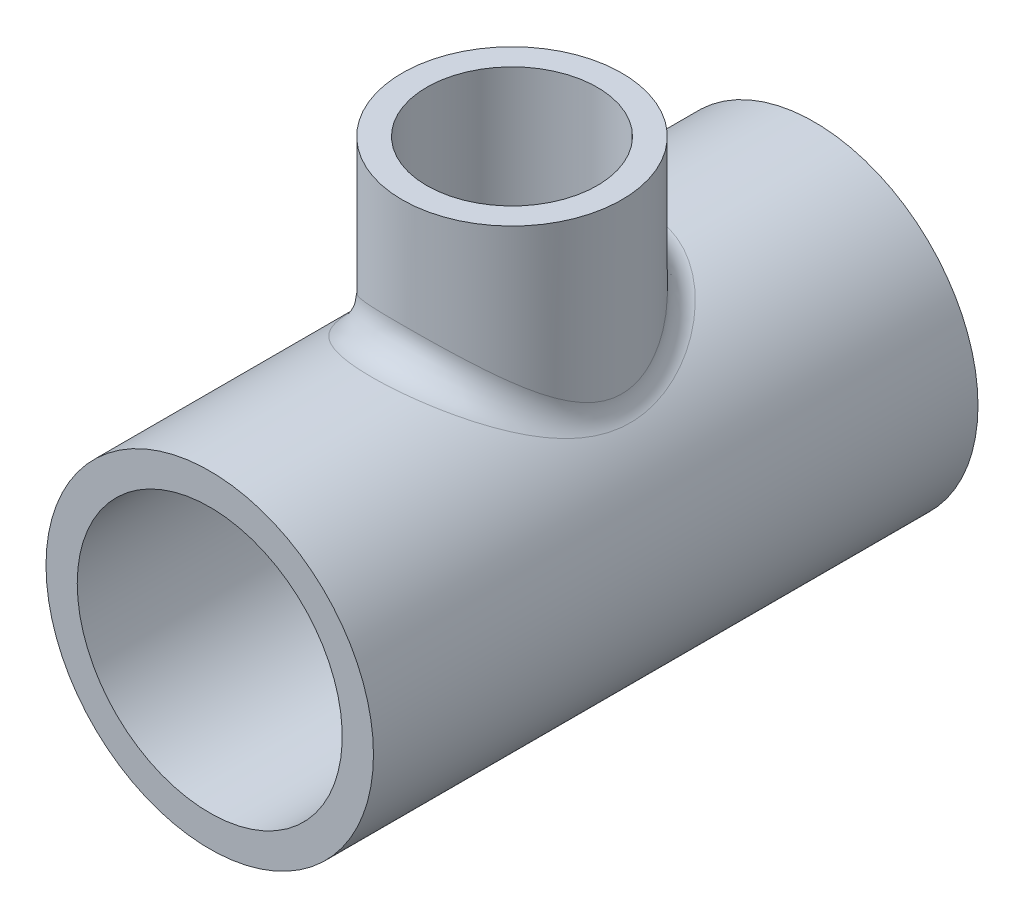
ISO-10303-21;
HEADER;
FILE_DESCRIPTION(('STEP AP214'),'2;1');
FILE_NAME('part.step','',(''),(''),'','','');
FILE_SCHEMA(('AUTOMOTIVE_DESIGN { 1 0 10303 214 1 1 1 1 }'));
ENDSEC;
DATA;
#1=APPLICATION_CONTEXT('core data for automotive mechanical design processes');
#2=APPLICATION_PROTOCOL_DEFINITION('international standard','automotive_design',2000,#1);
#3=PRODUCT_CONTEXT('',#1,'mechanical');
#4=PRODUCT('Part','Part','',(#3));
#5=PRODUCT_RELATED_PRODUCT_CATEGORY('part','',(#4));
#6=PRODUCT_DEFINITION_FORMATION('','',#4);
#7=PRODUCT_DEFINITION_CONTEXT('part definition',#1,'design');
#8=PRODUCT_DEFINITION('design','',#6,#7);
#9=PRODUCT_DEFINITION_SHAPE('','',#8);
#10=(LENGTH_UNIT() NAMED_UNIT(*) SI_UNIT(.MILLI.,.METRE.));
#11=(NAMED_UNIT(*) PLANE_ANGLE_UNIT() SI_UNIT($,.RADIAN.));
#12=(NAMED_UNIT(*) SI_UNIT($,.STERADIAN.) SOLID_ANGLE_UNIT());
#13=UNCERTAINTY_MEASURE_WITH_UNIT(LENGTH_MEASURE(1.E-05),#10,'distance_accuracy_value','');
#14=(GEOMETRIC_REPRESENTATION_CONTEXT(3) GLOBAL_UNCERTAINTY_ASSIGNED_CONTEXT((#13)) GLOBAL_UNIT_ASSIGNED_CONTEXT((#10,
#11,#12)) REPRESENTATION_CONTEXT('',''));
#15=CARTESIAN_POINT('',(0.,0.,0.));
#16=DIRECTION('',(0.,0.,1.));
#17=DIRECTION('',(1.,0.,0.));
#18=AXIS2_PLACEMENT_3D('',#15,#16,#17);
#19=CARTESIAN_POINT('',(0.,38.1,38.1));
#20=DIRECTION('',(0.,-1.,0.));
#21=DIRECTION('',(0.,0.,-1.));
#22=AXIS2_PLACEMENT_3D('',#19,#20,#21);
#23=CYLINDRICAL_SURFACE('',#22,10.1092);
#24=CARTESIAN_POINT('',(0.,16.0655,48.2092));
#25=CARTESIAN_POINT('',(0.256632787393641,16.0654998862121,48.2091999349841));
#26=CARTESIAN_POINT('',(0.513269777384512,16.0593374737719,48.1994151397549));
#27=CARTESIAN_POINT('',(1.02457464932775,16.034839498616,48.1604145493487));
#28=CARTESIAN_POINT('',(1.27924168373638,16.0164989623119,48.1311908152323));
#29=CARTESIAN_POINT('',(1.78492562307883,15.9680604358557,48.0536678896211));
#30=CARTESIAN_POINT('',(2.03593612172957,15.9379439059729,48.0053386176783));
#31=CARTESIAN_POINT('',(2.53206275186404,15.8666870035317,47.8902721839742));
#32=CARTESIAN_POINT('',(2.77717940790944,15.8255476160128,47.8235366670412));
#33=CARTESIAN_POINT('',(3.25875908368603,15.7334227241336,47.6728657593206));
#34=CARTESIAN_POINT('',(3.4952591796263,15.6824873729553,47.5890178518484));
#35=CARTESIAN_POINT('',(3.95958518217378,15.5717356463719,47.4048373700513));
#36=CARTESIAN_POINT('',(4.18741092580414,15.5119191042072,47.3045044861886));
#37=CARTESIAN_POINT('',(4.63323208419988,15.3846408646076,47.0883500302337));
#38=CARTESIAN_POINT('',(4.85123136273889,15.3171822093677,46.9725346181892));
#39=CARTESIAN_POINT('',(5.27672292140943,15.17586130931,46.72627221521));
#40=CARTESIAN_POINT('',(5.48421127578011,15.1019966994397,46.5958198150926));
#41=CARTESIAN_POINT('',(5.90412203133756,14.9430914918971,46.3101655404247));
#42=CARTESIAN_POINT('',(6.11560548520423,14.8576296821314,46.1538178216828));
#43=CARTESIAN_POINT('',(6.52473971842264,14.6825604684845,45.8260862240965));
#44=CARTESIAN_POINT('',(6.7223899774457,14.5929529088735,45.6547017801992));
#45=CARTESIAN_POINT('',(7.10351514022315,14.4112796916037,45.2975199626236));
#46=CARTESIAN_POINT('',(7.286971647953,14.3192110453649,45.1117044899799));
#47=CARTESIAN_POINT('',(7.63887807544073,14.1346141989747,44.7265765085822));
#48=CARTESIAN_POINT('',(7.80732723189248,14.0420859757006,44.5272633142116));
#49=CARTESIAN_POINT('',(8.15078891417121,13.8459103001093,44.0873861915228));
#50=CARTESIAN_POINT('',(8.32350666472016,13.7424878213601,43.8449228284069));
#51=CARTESIAN_POINT('',(8.64778008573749,13.5407778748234,43.3441228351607));
#52=CARTESIAN_POINT('',(8.79933170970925,13.4424913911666,43.0857831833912));
#53=CARTESIAN_POINT('',(9.07981923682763,13.2546455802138,42.5545377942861));
#54=CARTESIAN_POINT('',(9.20878572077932,13.1650745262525,42.2816524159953));
#55=CARTESIAN_POINT('',(9.44283096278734,12.998227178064,41.7222500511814));
#56=CARTESIAN_POINT('',(9.54791977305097,12.9209457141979,41.4357388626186));
#57=CARTESIAN_POINT('',(9.70833200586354,12.800618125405,40.9276142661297));
#58=CARTESIAN_POINT('',(9.76947855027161,12.7539092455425,40.7086919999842));
#59=CARTESIAN_POINT('',(9.87719165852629,12.6706755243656,40.265409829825));
#60=CARTESIAN_POINT('',(9.92376180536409,12.6341481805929,40.0410512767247));
#61=CARTESIAN_POINT('',(10.0016606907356,12.5725711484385,39.5884147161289));
#62=CARTESIAN_POINT('',(10.0330075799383,12.5475077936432,39.3601417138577));
#63=CARTESIAN_POINT('',(10.0800620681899,12.5097384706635,38.900956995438));
#64=CARTESIAN_POINT('',(10.095769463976,12.4970326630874,38.6700452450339));
#65=CARTESIAN_POINT('',(10.1113017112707,12.4844692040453,38.2066921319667));
#66=CARTESIAN_POINT('',(10.111082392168,12.4846472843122,37.974248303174));
#67=CARTESIAN_POINT('',(10.094655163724,12.4979332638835,37.5103019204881));
#68=CARTESIAN_POINT('',(10.0784471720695,12.5110412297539,37.2787993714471));
#69=CARTESIAN_POINT('',(10.0302983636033,12.5496753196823,36.8183331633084));
#70=CARTESIAN_POINT('',(9.99834654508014,12.5752101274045,36.5893713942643));
#71=CARTESIAN_POINT('',(9.91919857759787,12.6377341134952,36.1357048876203));
#72=CARTESIAN_POINT('',(9.87200209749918,12.6747235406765,35.9110002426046));
#73=CARTESIAN_POINT('',(9.76436733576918,12.7578178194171,35.4727017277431));
#74=CARTESIAN_POINT('',(9.70429112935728,12.8036705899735,35.2589705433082));
#75=CARTESIAN_POINT('',(9.57088515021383,12.9036968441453,34.8376469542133));
#76=CARTESIAN_POINT('',(9.49755089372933,12.9578731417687,34.6300566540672));
#77=CARTESIAN_POINT('',(9.25865590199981,13.1307361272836,34.017704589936));
#78=CARTESIAN_POINT('',(9.07414801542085,13.2598011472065,33.6231416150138));
#79=CARTESIAN_POINT('',(8.61994334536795,13.5603851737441,32.7937330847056));
#80=CARTESIAN_POINT('',(8.34074085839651,13.7353193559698,32.3653388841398));
#81=CARTESIAN_POINT('',(7.87754505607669,14.0027352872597,31.7592600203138));
#82=CARTESIAN_POINT('',(7.71560184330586,14.0927830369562,31.5631783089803));
#83=CARTESIAN_POINT('',(7.37731492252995,14.2727774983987,31.1836599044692));
#84=CARTESIAN_POINT('',(7.2009686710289,14.3627241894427,31.0002254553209));
#85=CARTESIAN_POINT('',(6.8032462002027,14.5558568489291,30.6166492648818));
#86=CARTESIAN_POINT('',(6.5793131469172,14.6586918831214,30.4189742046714));
#87=CARTESIAN_POINT('',(6.11344726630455,14.8590145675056,30.0432517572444));
#88=CARTESIAN_POINT('',(5.87152100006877,14.95650414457,29.8651972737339));
#89=CARTESIAN_POINT('',(5.37060747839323,15.1435906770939,29.5300936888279));
#90=CARTESIAN_POINT('',(5.1116195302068,15.2331873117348,29.3730454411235));
#91=CARTESIAN_POINT('',(4.5779467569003,15.4019798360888,29.0816452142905));
#92=CARTESIAN_POINT('',(4.30326377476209,15.4811769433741,28.9472905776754));
#93=CARTESIAN_POINT('',(3.75461858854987,15.6230337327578,28.7093956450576));
#94=CARTESIAN_POINT('',(3.48136195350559,15.6863393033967,28.604616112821));
#95=CARTESIAN_POINT('',(2.92426523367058,15.7996750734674,28.4185322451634));
#96=CARTESIAN_POINT('',(2.64042532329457,15.8497054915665,28.3372275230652));
#97=CARTESIAN_POINT('',(2.06493409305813,15.9348938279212,28.1995252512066));
#98=CARTESIAN_POINT('',(1.773292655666,15.9700696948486,28.1430976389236));
#99=CARTESIAN_POINT('',(1.18472946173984,16.0244808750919,28.0560572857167));
#100=CARTESIAN_POINT('',(0.887808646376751,16.0437190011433,28.025439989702));
#101=CARTESIAN_POINT('',(0.336767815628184,16.0639680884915,27.9932290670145));
#102=CARTESIAN_POINT('',(0.0829389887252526,16.0672884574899,27.9879577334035));
#103=CARTESIAN_POINT('',(-0.424249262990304,16.0618987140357,27.9965233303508));
#104=CARTESIAN_POINT('',(-0.677608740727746,16.0531900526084,28.0103579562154));
#105=CARTESIAN_POINT('',(-1.18186710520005,16.0239592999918,28.0569311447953));
#106=CARTESIAN_POINT('',(-1.43276616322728,16.0034380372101,28.0896683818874));
#107=CARTESIAN_POINT('',(-1.9302566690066,15.951080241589,28.173587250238));
#108=CARTESIAN_POINT('',(-2.17684804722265,15.9192435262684,28.224769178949));
#109=CARTESIAN_POINT('',(-2.65372778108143,15.8465683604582,28.3423668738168));
#110=CARTESIAN_POINT('',(-2.884264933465,15.8061666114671,28.4080484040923));
#111=CARTESIAN_POINT('',(-3.33861088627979,15.7164756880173,28.5550205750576));
#112=CARTESIAN_POINT('',(-3.56241733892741,15.6671834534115,28.6363165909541));
#113=CARTESIAN_POINT('',(-4.00205630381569,15.5606871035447,28.813685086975));
#114=CARTESIAN_POINT('',(-4.21789111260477,15.5034852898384,28.9097532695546));
#115=CARTESIAN_POINT('',(-4.64082885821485,15.3821787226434,29.1159027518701));
#116=CARTESIAN_POINT('',(-4.84792859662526,15.3180714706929,29.2259891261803));
#117=CARTESIAN_POINT('',(-5.27279377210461,15.1773805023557,29.4710048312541));
#118=CARTESIAN_POINT('',(-5.4895610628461,15.1001901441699,29.6073170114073));
#119=CARTESIAN_POINT('',(-5.9108692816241,14.9403050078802,29.8949619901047));
#120=CARTESIAN_POINT('',(-6.11540480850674,14.8576078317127,30.0463013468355));
#121=CARTESIAN_POINT('',(-6.51168672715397,14.6882500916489,30.3631870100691));
#122=CARTESIAN_POINT('',(-6.70342314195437,14.6015865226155,30.52874417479));
#123=CARTESIAN_POINT('',(-7.07340909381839,14.4259875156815,30.8731954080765));
#124=CARTESIAN_POINT('',(-7.25165754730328,14.3370518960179,31.052090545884));
#125=CARTESIAN_POINT('',(-7.61944213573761,14.1454403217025,31.449899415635));
#126=CARTESIAN_POINT('',(-7.80676311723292,14.0426731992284,31.6708231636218));
#127=CARTESIAN_POINT('',(-8.16219750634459,13.8391032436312,32.1285318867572));
#128=CARTESIAN_POINT('',(-8.33030765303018,13.7383007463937,32.3653195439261));
#129=CARTESIAN_POINT('',(-8.64625190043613,13.5416843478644,32.8537822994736));
#130=CARTESIAN_POINT('',(-8.79409974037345,13.4458670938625,33.1054471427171));
#131=CARTESIAN_POINT('',(-9.06855577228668,13.2623095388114,33.6230568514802));
#132=CARTESIAN_POINT('',(-9.19515965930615,13.1745708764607,33.8890045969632));
#133=CARTESIAN_POINT('',(-9.40175733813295,13.02765603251,34.377386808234));
#134=CARTESIAN_POINT('',(-9.48597130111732,12.9663312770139,34.5973957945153));
#135=CARTESIAN_POINT('',(-9.63935821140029,12.8527107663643,35.0447486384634));
#136=CARTESIAN_POINT('',(-9.70854017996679,12.8004095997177,35.2720880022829));
#137=CARTESIAN_POINT('',(-9.8310531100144,12.7065591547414,35.732915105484));
#138=CARTESIAN_POINT('',(-9.88440157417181,12.6649980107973,35.9663957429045));
#139=CARTESIAN_POINT('',(-9.97459936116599,12.5940843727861,36.4383729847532));
#140=CARTESIAN_POINT('',(-10.0114487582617,12.5647318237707,36.6768695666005));
#141=CARTESIAN_POINT('',(-10.0682161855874,12.5192913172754,37.1586523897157));
#142=CARTESIAN_POINT('',(-10.0880279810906,12.5032866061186,37.4019591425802));
#143=CARTESIAN_POINT('',(-10.1099661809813,12.4855547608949,37.8898941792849));
#144=CARTESIAN_POINT('',(-10.1120926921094,12.4838275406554,38.13452245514));
#145=CARTESIAN_POINT('',(-10.0986182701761,12.4947297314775,38.6230266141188));
#146=CARTESIAN_POINT('',(-10.0830127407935,12.5073628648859,38.8669022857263));
#147=CARTESIAN_POINT('',(-10.0343592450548,12.5464293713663,39.3517712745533));
#148=CARTESIAN_POINT('',(-10.001311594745,12.5728624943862,39.5927646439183));
#149=CARTESIAN_POINT('',(-9.92194903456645,12.6355660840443,40.0493023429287));
#150=CARTESIAN_POINT('',(-9.87703618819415,12.6707823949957,40.2652386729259));
#151=CARTESIAN_POINT('',(-9.77369883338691,12.7506607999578,40.6921042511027));
#152=CARTESIAN_POINT('',(-9.71526984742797,12.7953260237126,40.9030318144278));
#153=CARTESIAN_POINT('',(-9.52063461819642,12.9415697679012,41.5268112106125));
#154=CARTESIAN_POINT('',(-9.36504271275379,13.0554273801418,41.9308702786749));
#155=CARTESIAN_POINT('',(-8.98146877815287,13.3227370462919,42.7657771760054));
#156=CARTESIAN_POINT('',(-8.74633265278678,13.4795187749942,43.192243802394));
#157=CARTESIAN_POINT('',(-8.35210614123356,13.7246754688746,43.8005908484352));
#158=CARTESIAN_POINT('',(-8.21367389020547,13.8081156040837,43.9982654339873));
#159=CARTESIAN_POINT('',(-7.92337996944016,13.9767121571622,44.3828343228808));
#160=CARTESIAN_POINT('',(-7.77151614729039,14.0618688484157,44.5697268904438));
#161=CARTESIAN_POINT('',(-7.42250562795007,14.2496873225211,44.9692319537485));
#162=CARTESIAN_POINT('',(-7.22244674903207,14.352370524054,45.1792967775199));
#163=CARTESIAN_POINT('',(-6.80441147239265,14.555213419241,45.581985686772));
#164=CARTESIAN_POINT('',(-6.58643955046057,14.6553737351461,45.7746141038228));
#165=CARTESIAN_POINT('',(-6.13310689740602,14.8508001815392,46.1415189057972));
#166=CARTESIAN_POINT('',(-5.89773003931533,14.9460616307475,46.3157778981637));
#167=CARTESIAN_POINT('',(-5.41073272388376,15.1291745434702,46.6443643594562));
#168=CARTESIAN_POINT('',(-5.15911347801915,15.2170265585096,46.7986933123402));
#169=CARTESIAN_POINT('',(-4.63867620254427,15.3837002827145,47.0870925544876));
#170=CARTESIAN_POINT('',(-4.36973278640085,15.4624410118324,47.2209841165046));
#171=CARTESIAN_POINT('',(-3.81824384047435,15.607773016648,47.4652469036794));
#172=CARTESIAN_POINT('',(-3.53570096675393,15.674366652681,47.5756226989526));
#173=CARTESIAN_POINT('',(-2.95993962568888,15.7932010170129,47.7709266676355));
#174=CARTESIAN_POINT('',(-2.66675407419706,15.8454823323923,47.8559268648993));
#175=CARTESIAN_POINT('',(-2.07177735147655,15.9341885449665,47.9993527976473));
#176=CARTESIAN_POINT('',(-1.769992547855,15.9706248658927,48.0577976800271));
#177=CARTESIAN_POINT('',(-1.22357556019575,16.0206807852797,48.1378578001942));
#178=CARTESIAN_POINT('',(-0.979964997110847,16.0374530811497,48.1645775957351));
#179=CARTESIAN_POINT('',(-0.490904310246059,16.0598630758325,48.2002492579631));
#180=CARTESIAN_POINT('',(-0.245454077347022,16.0655001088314,48.2092000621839));
#181=CARTESIAN_POINT('',(0.,16.0655,48.2092));
#182=B_SPLINE_CURVE_WITH_KNOTS('',3,(#24,#25,#26,#27,#28,#29,#30,#31,#32,#33,#34,#35,#36,#37,
#38,#39,#40,#41,#42,#43,#44,#45,#46,#47,#48,#49,#50,#51,#52,#53,#54,#55,#56,#57,#58,#59,#60,#61,
#62,#63,#64,#65,#66,#67,#68,#69,#70,#71,#72,#73,#74,#75,#76,#77,#78,#79,#80,#81,#82,#83,#84,#85,
#86,#87,#88,#89,#90,#91,#92,#93,#94,#95,#96,#97,#98,#99,#100,#101,#102,#103,#104,#105,#106,#107,
#108,#109,#110,#111,#112,#113,#114,#115,#116,#117,#118,#119,#120,#121,#122,#123,#124,#125,#126,
#127,#128,#129,#130,#131,#132,#133,#134,#135,#136,#137,#138,#139,#140,#141,#142,#143,#144,#145,
#146,#147,#148,#149,#150,#151,#152,#153,#154,#155,#156,#157,#158,#159,#160,#161,#162,#163,#164,
#165,#166,#167,#168,#169,#170,#171,#172,#173,#174,#175,#176,#177,#178,#179,#180,#181),
.UNSPECIFIED.,.T.,.F.,(4,2,2,2,2,2,2,2,2,2,2,2,2,2,2,2,2,2,2,2,2,2,2,2,2,2,2,2,2,2,2,2,2,2,2,2,
2,2,2,2,2,2,2,2,2,2,2,2,2,2,2,2,2,2,2,2,2,2,2,2,2,2,2,2,2,2,2,2,2,2,2,2,2,2,2,2,2,2,4),(0.,
0.769647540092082,1.53960960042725,2.310788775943,3.08189905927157,3.84916175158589,
4.61643885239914,5.38341157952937,6.15066868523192,6.97946209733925,7.80828666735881,
8.63816805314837,9.46809162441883,10.4123901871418,11.3568690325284,12.3000589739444,
13.2428511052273,13.9383324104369,14.6336426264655,15.328121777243,16.022609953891,
16.7190242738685,17.4154421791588,18.1123474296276,18.809267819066,19.488696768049,
20.1683559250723,21.5269875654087,23.14203303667,23.9508382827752,24.7597866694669,
25.7063565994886,26.6525830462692,27.5988479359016,28.5450019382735,29.441945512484,
30.3388743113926,31.2347162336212,32.1304000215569,32.8911416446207,33.6517915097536,
34.412388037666,35.1729968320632,35.9014993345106,36.6302530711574,37.3587951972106,
38.0876018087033,38.889140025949,39.6910296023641,40.4935371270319,41.2961090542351,
42.217100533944,43.1382481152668,44.0587679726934,44.9794741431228,45.7090818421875,
46.4382504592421,47.1666100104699,47.8949662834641,48.6278318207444,49.3606929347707,
50.0937440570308,50.8267818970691,51.4961351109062,52.1657103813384,53.5042193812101,
55.0333701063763,55.7989366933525,56.5646261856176,57.4867708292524,58.4086857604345,
59.3314658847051,60.2541772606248,61.1845450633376,62.1147318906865,63.0422528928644,
63.9691040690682,64.7051823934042,65.4413047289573),.UNSPECIFIED.);
#183=CARTESIAN_POINT('',(0.,16.0655,48.2092));
#184=VERTEX_POINT('',#183);
#185=EDGE_CURVE('E127',#184,#184,#182,.T.);
#186=ORIENTED_EDGE('',*,*,#185,.F.);
#187=EDGE_LOOP('',(#186));
#188=FACE_BOUND('',#187,.T.);
#189=CARTESIAN_POINT('',(0.,19.05,38.1));
#190=DIRECTION('',(0.,1.,0.));
#191=DIRECTION('',(0.,0.,1.));
#192=AXIS2_PLACEMENT_3D('',#189,#190,#191);
#193=CIRCLE('',#192,10.1092);
#194=CARTESIAN_POINT('',(0.,19.05,48.2092));
#195=VERTEX_POINT('',#194);
#196=EDGE_CURVE('E134',#195,#195,#193,.T.);
#197=ORIENTED_EDGE('',*,*,#196,.T.);
#198=EDGE_LOOP('',(#197));
#199=FACE_BOUND('',#198,.T.);
#200=ADVANCED_FACE('F38',(#188,#199),#23,.F.);
#201=CARTESIAN_POINT('',(0.,0.,76.2));
#202=DIRECTION('',(0.,0.,-1.));
#203=DIRECTION('',(-1.,0.,0.));
#204=AXIS2_PLACEMENT_3D('',#201,#202,#203);
#205=CYLINDRICAL_SURFACE('',#204,16.7005);
#206=CARTESIAN_POINT('',(0.,0.,76.2));
#207=DIRECTION('',(0.,0.,1.));
#208=DIRECTION('',(1.,0.,0.));
#209=AXIS2_PLACEMENT_3D('',#206,#207,#208);
#210=CIRCLE('',#209,16.7005);
#211=CARTESIAN_POINT('',(-16.7005,0.,76.2));
#212=VERTEX_POINT('',#211);
#213=EDGE_CURVE('E166',#212,#212,#210,.T.);
#214=CARTESIAN_POINT('',(0.,0.,50.8));
#215=DIRECTION('',(0.,0.,-1.));
#216=DIRECTION('',(-1.,0.,0.));
#217=AXIS2_PLACEMENT_3D('',#214,#215,#216);
#218=CIRCLE('',#217,16.7005);
#219=CARTESIAN_POINT('',(-16.7005,0.,50.8));
#220=VERTEX_POINT('',#219);
#221=EDGE_CURVE('E135',#220,#220,#218,.T.);
#222=CARTESIAN_POINT('',(-16.7005,0.,76.2));
#223=CARTESIAN_POINT('',(-16.7005,0.,75.9354166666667));
#224=CARTESIAN_POINT('',(-16.7005,0.,75.6708333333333));
#225=CARTESIAN_POINT('',(-16.7005,0.,75.1416666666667));
#226=CARTESIAN_POINT('',(-16.7005,0.,74.8770833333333));
#227=CARTESIAN_POINT('',(-16.7005,0.,74.3479166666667));
#228=CARTESIAN_POINT('',(-16.7005,0.,74.0833333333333));
#229=CARTESIAN_POINT('',(-16.7005,0.,73.5541666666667));
#230=CARTESIAN_POINT('',(-16.7005,0.,73.2895833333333));
#231=CARTESIAN_POINT('',(-16.7005,0.,72.7604166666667));
#232=CARTESIAN_POINT('',(-16.7005,0.,72.4958333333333));
#233=CARTESIAN_POINT('',(-16.7005,0.,71.9666666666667));
#234=CARTESIAN_POINT('',(-16.7005,0.,71.7020833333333));
#235=CARTESIAN_POINT('',(-16.7005,0.,71.1729166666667));
#236=CARTESIAN_POINT('',(-16.7005,0.,70.9083333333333));
#237=CARTESIAN_POINT('',(-16.7005,0.,70.3791666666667));
#238=CARTESIAN_POINT('',(-16.7005,0.,70.1145833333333));
#239=CARTESIAN_POINT('',(-16.7005,0.,69.5854166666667));
#240=CARTESIAN_POINT('',(-16.7005,0.,69.3208333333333));
#241=CARTESIAN_POINT('',(-16.7005,0.,68.7916666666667));
#242=CARTESIAN_POINT('',(-16.7005,0.,68.5270833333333));
#243=CARTESIAN_POINT('',(-16.7005,0.,67.9979166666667));
#244=CARTESIAN_POINT('',(-16.7005,0.,67.7333333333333));
#245=CARTESIAN_POINT('',(-16.7005,0.,67.2041666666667));
#246=CARTESIAN_POINT('',(-16.7005,0.,66.9395833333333));
#247=CARTESIAN_POINT('',(-16.7005,0.,66.4104166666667));
#248=CARTESIAN_POINT('',(-16.7005,0.,66.1458333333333));
#249=CARTESIAN_POINT('',(-16.7005,0.,65.6166666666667));
#250=CARTESIAN_POINT('',(-16.7005,0.,65.3520833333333));
#251=CARTESIAN_POINT('',(-16.7005,0.,64.8229166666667));
#252=CARTESIAN_POINT('',(-16.7005,0.,64.5583333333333));
#253=CARTESIAN_POINT('',(-16.7005,0.,64.0291666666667));
#254=CARTESIAN_POINT('',(-16.7005,0.,63.7645833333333));
#255=CARTESIAN_POINT('',(-16.7005,0.,63.2354166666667));
#256=CARTESIAN_POINT('',(-16.7005,0.,62.9708333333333));
#257=CARTESIAN_POINT('',(-16.7005,0.,62.4416666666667));
#258=CARTESIAN_POINT('',(-16.7005,0.,62.1770833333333));
#259=CARTESIAN_POINT('',(-16.7005,0.,61.6479166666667));
#260=CARTESIAN_POINT('',(-16.7005,0.,61.3833333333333));
#261=CARTESIAN_POINT('',(-16.7005,0.,60.8541666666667));
#262=CARTESIAN_POINT('',(-16.7005,0.,60.5895833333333));
#263=CARTESIAN_POINT('',(-16.7005,0.,60.0604166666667));
#264=CARTESIAN_POINT('',(-16.7005,0.,59.7958333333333));
#265=CARTESIAN_POINT('',(-16.7005,0.,59.2666666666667));
#266=CARTESIAN_POINT('',(-16.7005,0.,59.0020833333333));
#267=CARTESIAN_POINT('',(-16.7005,0.,58.4729166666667));
#268=CARTESIAN_POINT('',(-16.7005,0.,58.2083333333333));
#269=CARTESIAN_POINT('',(-16.7005,0.,57.6791666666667));
#270=CARTESIAN_POINT('',(-16.7005,0.,57.4145833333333));
#271=CARTESIAN_POINT('',(-16.7005,0.,56.8854166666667));
#272=CARTESIAN_POINT('',(-16.7005,0.,56.6208333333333));
#273=CARTESIAN_POINT('',(-16.7005,0.,56.0916666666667));
#274=CARTESIAN_POINT('',(-16.7005,0.,55.8270833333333));
#275=CARTESIAN_POINT('',(-16.7005,0.,55.2979166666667));
#276=CARTESIAN_POINT('',(-16.7005,0.,55.0333333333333));
#277=CARTESIAN_POINT('',(-16.7005,0.,54.5041666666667));
#278=CARTESIAN_POINT('',(-16.7005,0.,54.2395833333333));
#279=CARTESIAN_POINT('',(-16.7005,0.,53.7104166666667));
#280=CARTESIAN_POINT('',(-16.7005,0.,53.4458333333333));
#281=CARTESIAN_POINT('',(-16.7005,0.,52.9166666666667));
#282=CARTESIAN_POINT('',(-16.7005,0.,52.6520833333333));
#283=CARTESIAN_POINT('',(-16.7005,0.,52.1229166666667));
#284=CARTESIAN_POINT('',(-16.7005,0.,51.8583333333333));
#285=CARTESIAN_POINT('',(-16.7005,0.,51.3291666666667));
#286=CARTESIAN_POINT('',(-16.7005,0.,51.0645833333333));
#287=CARTESIAN_POINT('',(-16.7005,0.,50.8));
#288=B_SPLINE_CURVE_WITH_KNOTS('',3,(#222,#223,#224,#225,#226,#227,#228,#229,#230,#231,#232,
#233,#234,#235,#236,#237,#238,#239,#240,#241,#242,#243,#244,#245,#246,#247,#248,#249,#250,#251,
#252,#253,#254,#255,#256,#257,#258,#259,#260,#261,#262,#263,#264,#265,#266,#267,#268,#269,#270,
#271,#272,#273,#274,#275,#276,#277,#278,#279,#280,#281,#282,#283,#284,#285,#286,#287),
.UNSPECIFIED.,.F.,.F.,(4,2,2,2,2,2,2,2,2,2,2,2,2,2,2,2,2,2,2,2,2,2,2,2,2,2,2,2,2,2,2,2,4),(0.,
0.79375000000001,1.58750000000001,2.38125,3.17500000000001,3.96875000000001,4.7625,5.55625,
6.35000000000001,7.14375,7.9375,8.73125000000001,9.52500000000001,10.31875,11.1125,11.90625,
12.7,13.49375,14.2875,15.08125,15.875,16.66875,17.4625,18.25625,19.05,19.84375,20.6375,21.43125,
22.225,23.01875,23.8125,24.60625,25.4),.UNSPECIFIED.);
#289=EDGE_CURVE('BSEAM73',#212,#220,#288,.T.);
#290=ORIENTED_EDGE('',*,*,#213,.T.);
#291=ORIENTED_EDGE('',*,*,#221,.T.);
#292=ORIENTED_EDGE('',*,*,#289,.T.);
#293=ORIENTED_EDGE('',*,*,#289,.F.);
#294=EDGE_LOOP('',(#290,#292,#291,#293));
#295=FACE_BOUND('',#294,.T.);
#296=ADVANCED_FACE('F73',(#295),#205,.F.);
#297=CARTESIAN_POINT('',(0.,0.,76.2));
#298=DIRECTION('',(0.,0.,-1.));
#299=DIRECTION('',(-1.,0.,0.));
#300=AXIS2_PLACEMENT_3D('',#297,#298,#299);
#301=CYLINDRICAL_SURFACE('',#300,20.6375);
#302=CARTESIAN_POINT('',(1.07788148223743,20.6093322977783,20.4932399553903));
#303=CARTESIAN_POINT('',(0.804083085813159,20.6236521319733,24.2789582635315));
#304=CARTESIAN_POINT('',(1.00129045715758,24.414132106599,24.2932601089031));
#305=CARTESIAN_POINT('',(1.42097956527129,20.5913897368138,20.5227135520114));
#306=CARTESIAN_POINT('',(1.06085618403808,20.6147857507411,24.2930119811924));
#307=CARTESIAN_POINT('',(1.32000901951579,24.3928770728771,24.3163724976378));
#308=CARTESIAN_POINT('',(1.762745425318,20.5649083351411,20.5662397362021));
#309=CARTESIAN_POINT('',(1.31828593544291,20.6016397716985,24.3138416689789));
#310=CARTESIAN_POINT('',(1.63749002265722,24.3615067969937,24.3505045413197));
#311=CARTESIAN_POINT('',(2.44128541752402,20.4954344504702,20.680768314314));
#312=CARTESIAN_POINT('',(1.83592383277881,20.5661506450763,24.3700005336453));
#313=CARTESIAN_POINT('',(2.26781499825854,24.2792069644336,24.4403147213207));
#314=CARTESIAN_POINT('',(2.77805942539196,20.4524415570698,20.7517713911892));
#315=CARTESIAN_POINT('',(2.09557330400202,20.543886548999,24.4052048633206));
#316=CARTESIAN_POINT('',(2.58065885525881,24.2282769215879,24.4959933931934));
#317=CARTESIAN_POINT('',(3.44444182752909,20.3508193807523,20.9202978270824));
#318=CARTESIAN_POINT('',(2.61790091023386,20.4894188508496,24.4912548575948));
#319=CARTESIAN_POINT('',(3.19969012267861,24.1078937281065,24.6281472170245));
#320=CARTESIAN_POINT('',(3.77404977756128,20.2921891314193,21.017822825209));
#321=CARTESIAN_POINT('',(2.88006711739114,20.4573305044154,24.5419188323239));
#322=CARTESIAN_POINT('',(3.5058771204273,24.0384394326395,24.704623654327));
#323=CARTESIAN_POINT('',(4.42420196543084,20.1604287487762,21.2381783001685));
#324=CARTESIAN_POINT('',(3.40695240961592,20.3824923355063,24.6601055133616));
#325=CARTESIAN_POINT('',(4.10983144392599,23.8823540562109,24.8774203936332));
#326=CARTESIAN_POINT('',(4.74474576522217,20.0872979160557,21.3610099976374));
#327=CARTESIAN_POINT('',(3.67122604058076,20.3398891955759,24.7273963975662));
#328=CARTESIAN_POINT('',(4.4075983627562,23.795722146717,24.9737416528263));
#329=CARTESIAN_POINT('',(5.38451614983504,19.925497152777,21.6346067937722));
#330=CARTESIAN_POINT('',(4.20898653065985,20.2420673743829,24.8821758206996));
#331=CARTESIAN_POINT('',(5.00190858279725,23.6040504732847,25.1882887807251));
#332=CARTESIAN_POINT('',(5.70342342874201,19.8364316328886,21.7860905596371));
#333=CARTESIAN_POINT('',(4.48220291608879,20.1866812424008,24.969933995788));
#334=CARTESIAN_POINT('',(5.29815526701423,23.4985420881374,25.3070782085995));
#335=CARTESIAN_POINT('',(6.32863046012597,19.6459100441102,22.1128959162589));
#336=CARTESIAN_POINT('',(5.02839839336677,20.0638224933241,25.1653769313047));
#337=CARTESIAN_POINT('',(5.87893696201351,23.2728472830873,25.5633500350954));
#338=CARTESIAN_POINT('',(6.63492595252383,19.5444498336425,22.2882254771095));
#339=CARTESIAN_POINT('',(5.30108972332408,19.9965419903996,25.2727487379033));
#340=CARTESIAN_POINT('',(6.16346801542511,23.1526559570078,25.7008386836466));
#341=CARTESIAN_POINT('',(7.53296397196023,19.2240535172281,22.8475244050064));
#342=CARTESIAN_POINT('',(6.11090926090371,19.7780344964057,25.6235588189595));
#343=CARTESIAN_POINT('',(6.99769414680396,22.7731095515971,26.1394256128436));
#344=CARTESIAN_POINT('',(8.10432691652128,18.9889793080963,23.2650074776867));
#345=CARTESIAN_POINT('',(6.64854037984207,19.6086891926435,25.8979300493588));
#346=CARTESIAN_POINT('',(7.52845775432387,22.4946370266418,26.4668044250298));
#347=CARTESIAN_POINT('',(9.27241068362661,18.4500856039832,24.2505443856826));
#348=CARTESIAN_POINT('',(7.77822169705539,19.1980255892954,26.5793401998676));
#349=CARTESIAN_POINT('',(8.6135409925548,21.8562552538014,27.2396355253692));
#350=CARTESIAN_POINT('',(9.8587532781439,18.1412772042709,24.8319806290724));
#351=CARTESIAN_POINT('',(8.36813702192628,18.9503409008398,26.998755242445));
#352=CARTESIAN_POINT('',(9.15821984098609,21.4904360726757,27.6955819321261));
#353=CARTESIAN_POINT('',(10.6740302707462,17.6655374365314,25.7734100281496));
#354=CARTESIAN_POINT('',(9.21231156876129,18.5484238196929,27.712291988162));
#355=CARTESIAN_POINT('',(9.9155656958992,20.9268674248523,28.43382513));
#356=CARTESIAN_POINT('',(10.9354076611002,17.5046327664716,26.0992766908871));
#357=CARTESIAN_POINT('',(9.484861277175,18.4106570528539,27.9617730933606));
#358=CARTESIAN_POINT('',(10.1583703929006,20.7362572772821,28.6893608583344));
#359=CARTESIAN_POINT('',(11.4361399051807,17.1816683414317,26.7731725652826));
#360=CARTESIAN_POINT('',(10.0120043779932,18.1293415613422,28.4860048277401));
#361=CARTESIAN_POINT('',(10.6235221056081,20.3536686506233,29.2178115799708));
#362=CARTESIAN_POINT('',(11.6754995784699,17.0196088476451,27.1211968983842));
#363=CARTESIAN_POINT('',(10.2669645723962,17.9857967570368,28.7605597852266));
#364=CARTESIAN_POINT('',(10.8458735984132,20.1616904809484,29.4907227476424));
#365=CARTESIAN_POINT('',(12.1715453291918,16.6693574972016,27.9014266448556));
#366=CARTESIAN_POINT('',(10.7988462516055,17.67148149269,29.3836263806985));
#367=CARTESIAN_POINT('',(11.3066718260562,19.7467773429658,30.1025575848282));
#368=CARTESIAN_POINT('',(12.4239440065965,16.4815505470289,28.3377116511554));
#369=CARTESIAN_POINT('',(11.0730975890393,17.4998344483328,29.7373189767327));
#370=CARTESIAN_POINT('',(11.5411358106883,19.5242983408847,30.4446803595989));
#371=CARTESIAN_POINT('',(12.8964532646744,16.114509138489,29.2392466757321));
#372=CARTESIAN_POINT('',(11.589809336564,17.1601511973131,30.4771848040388));
#373=CARTESIAN_POINT('',(11.9800699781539,19.0894954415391,31.1516394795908));
#374=CARTESIAN_POINT('',(13.116553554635,15.9352774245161,29.7045058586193));
#375=CARTESIAN_POINT('',(11.8329914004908,16.9918535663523,30.8634304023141));
#376=CARTESIAN_POINT('',(12.1845306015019,18.8771747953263,31.5164830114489));
#377=CARTESIAN_POINT('',(13.5220519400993,15.5926518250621,30.6619592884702));
#378=CARTESIAN_POINT('',(12.2829895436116,16.6671845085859,31.6657383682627));
#379=CARTESIAN_POINT('',(12.5612154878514,18.4712952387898,32.2672918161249));
#380=CARTESIAN_POINT('',(13.7075381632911,15.4292182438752,31.1540808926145));
#381=CARTESIAN_POINT('',(12.4906285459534,16.5104131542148,32.0819861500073));
#382=CARTESIAN_POINT('',(12.733521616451,18.2776893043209,32.6532001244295));
#383=CARTESIAN_POINT('',(14.0419952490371,15.1254707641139,32.1652829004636));
#384=CARTESIAN_POINT('',(12.8660027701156,16.2172694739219,32.9431270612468));
#385=CARTESIAN_POINT('',(13.044213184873,17.9178653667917,33.446157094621));
#386=CARTESIAN_POINT('',(14.1909727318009,14.9851526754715,32.6843583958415));
#387=CARTESIAN_POINT('',(13.0344501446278,16.0804419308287,33.3885269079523));
#388=CARTESIAN_POINT('',(13.1826047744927,17.7516424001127,33.853201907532));
#389=CARTESIAN_POINT('',(14.402497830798,14.7813257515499,33.5545638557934));
#390=CARTESIAN_POINT('',(13.2741739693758,15.8807557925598,34.1395449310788));
#391=CARTESIAN_POINT('',(13.3790995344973,17.5101858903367,34.5355932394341));
#392=CARTESIAN_POINT('',(14.4768266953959,14.7083810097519,33.8986264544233));
#393=CARTESIAN_POINT('',(13.3585843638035,15.8090379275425,34.4371720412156));
#394=CARTESIAN_POINT('',(13.4481468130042,17.4237744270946,34.8053977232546));
#395=CARTESIAN_POINT('',(14.6083269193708,14.5777840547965,34.5951503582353));
#396=CARTESIAN_POINT('',(13.5080122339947,15.6804201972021,35.040997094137));
#397=CARTESIAN_POINT('',(13.5703030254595,17.2690672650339,35.3515927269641));
#398=CARTESIAN_POINT('',(14.6655097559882,14.5201216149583,34.9476058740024));
#399=CARTESIAN_POINT('',(13.573182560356,15.6233968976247,35.3474355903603));
#400=CARTESIAN_POINT('',(13.6234226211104,17.2007594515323,35.6279787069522));
#401=CARTESIAN_POINT('',(14.761831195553,14.4221870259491,35.6587904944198));
#402=CARTESIAN_POINT('',(13.6829623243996,15.5264741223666,35.9666244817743));
#403=CARTESIAN_POINT('',(13.712899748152,17.0847446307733,36.185670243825));
#404=CARTESIAN_POINT('',(14.8009965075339,14.3818891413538,36.0175094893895));
#405=CARTESIAN_POINT('',(13.7277113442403,15.486455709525,36.2796514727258));
#406=CARTESIAN_POINT('',(13.7492820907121,17.0370071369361,36.4669678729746));
#407=CARTESIAN_POINT('',(14.8607092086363,14.3201811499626,36.7394153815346));
#408=CARTESIAN_POINT('',(13.7959024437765,15.4251845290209,36.9099911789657));
#409=CARTESIAN_POINT('',(13.8047517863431,16.963906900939,37.0330667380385));
#410=CARTESIAN_POINT('',(14.8812563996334,14.2987712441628,37.102602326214));
#411=CARTESIAN_POINT('',(13.8194154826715,15.4038686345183,37.2276245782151));
#412=CARTESIAN_POINT('',(13.8238389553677,16.9385443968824,37.3178680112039));
#413=CARTESIAN_POINT('',(14.9033644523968,14.2757276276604,37.8321065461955));
#414=CARTESIAN_POINT('',(13.8446884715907,15.3809493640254,37.8655497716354));
#415=CARTESIAN_POINT('',(13.844376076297,16.9112465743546,37.8899252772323));
#416=CARTESIAN_POINT('',(14.9048505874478,14.2741717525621,38.1984305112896));
#417=CARTESIAN_POINT('',(13.8463901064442,15.3793988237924,38.1861910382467));
#418=CARTESIAN_POINT('',(13.8457566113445,16.9094034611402,38.1771865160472));
#419=CARTESIAN_POINT('',(14.8886131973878,14.291106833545,38.9298102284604));
#420=CARTESIAN_POINT('',(13.8278268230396,15.3962446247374,38.8258260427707));
#421=CARTESIAN_POINT('',(13.8306730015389,16.9294650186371,38.7507144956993));
#422=CARTESIAN_POINT('',(14.8708899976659,14.3095974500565,39.2948660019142));
#423=CARTESIAN_POINT('',(13.8075421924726,15.4146588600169,39.1451650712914));
#424=CARTESIAN_POINT('',(13.8142091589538,16.9513692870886,39.0369812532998));
#425=CARTESIAN_POINT('',(14.8165630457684,14.3658407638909,40.0212835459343));
#426=CARTESIAN_POINT('',(13.7454879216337,15.4705240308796,39.7796434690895));
#427=CARTESIAN_POINT('',(13.7637425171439,17.0179959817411,39.6066180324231));
#428=CARTESIAN_POINT('',(14.7799383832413,14.4036147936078,40.3826407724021));
#429=CARTESIAN_POINT('',(13.7036287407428,15.5080547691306,40.0951065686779));
#430=CARTESIAN_POINT('',(13.729720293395,17.0627436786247,39.8899844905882));
#431=CARTESIAN_POINT('',(14.6884721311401,14.4968766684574,41.0988395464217));
#432=CARTESIAN_POINT('',(13.5993467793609,15.6004063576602,40.7189794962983));
#433=CARTESIAN_POINT('',(13.6447533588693,17.1732231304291,40.4516079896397));
#434=CARTESIAN_POINT('',(14.6336280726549,14.5523669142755,41.453680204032));
#435=CARTESIAN_POINT('',(13.5368154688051,15.6553208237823,41.0276857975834));
#436=CARTESIAN_POINT('',(13.5938063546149,17.2389577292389,40.7298643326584));
#437=CARTESIAN_POINT('',(14.4922873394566,14.6932666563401,42.2338159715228));
#438=CARTESIAN_POINT('',(13.3760609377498,15.79425090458,41.7047291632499));
#439=CARTESIAN_POINT('',(13.4625088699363,17.4058697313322,41.3416254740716));
#440=CARTESIAN_POINT('',(14.4014464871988,14.7825979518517,42.6570146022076));
#441=CARTESIAN_POINT('',(13.2728206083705,15.8821554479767,42.070964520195));
#442=CARTESIAN_POINT('',(13.3781228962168,17.5116929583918,41.6734862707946));
#443=CARTESIAN_POINT('',(14.1954008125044,14.9805663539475,43.4884510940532));
#444=CARTESIAN_POINT('',(13.0397082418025,16.0757251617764,42.7872004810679));
#445=CARTESIAN_POINT('',(13.186718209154,17.7462093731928,42.3254760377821));
#446=CARTESIAN_POINT('',(14.0801900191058,15.0892081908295,43.896685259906));
#447=CARTESIAN_POINT('',(12.909524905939,16.1816225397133,43.137565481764));
#448=CARTESIAN_POINT('',(13.0796939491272,17.8749081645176,42.6456021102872));
#449=CARTESIAN_POINT('',(13.8267429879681,15.3217884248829,44.6975607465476));
#450=CARTESIAN_POINT('',(12.6246341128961,16.4066439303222,43.8210781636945));
#451=CARTESIAN_POINT('',(12.8442561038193,18.1504262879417,43.2736267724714));
#452=CARTESIAN_POINT('',(13.688463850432,15.4457552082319,45.0901712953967));
#453=CARTESIAN_POINT('',(12.4695445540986,16.5260144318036,44.154457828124));
#454=CARTESIAN_POINT('',(12.7158026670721,18.297279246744,43.5815012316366));
#455=CARTESIAN_POINT('',(13.3903534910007,15.7048993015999,45.8582727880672));
#456=CARTESIAN_POINT('',(12.1372046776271,16.7734027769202,44.8023095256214));
#457=CARTESIAN_POINT('',(12.4388751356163,18.6042653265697,44.1838254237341));
#458=CARTESIAN_POINT('',(13.2305211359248,15.8400772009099,46.233762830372));
#459=CARTESIAN_POINT('',(11.9595987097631,16.9016198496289,45.1169564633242));
#460=CARTESIAN_POINT('',(12.2903999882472,18.7643991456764,44.4782744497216));
#461=CARTESIAN_POINT('',(12.8418830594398,16.1577233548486,47.0717038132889));
#462=CARTESIAN_POINT('',(11.5301627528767,17.2002933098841,45.8144425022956));
#463=CARTESIAN_POINT('',(11.929377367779,19.1406876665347,45.1353648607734));
#464=CARTESIAN_POINT('',(12.6063943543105,16.3427002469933,47.5284851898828));
#465=CARTESIAN_POINT('',(11.2716443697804,17.3721828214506,46.1901842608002));
#466=CARTESIAN_POINT('',(11.7106217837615,19.3598141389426,45.4935603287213));
#467=CARTESIAN_POINT('',(12.1030803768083,16.7188708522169,48.4125656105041));
#468=CARTESIAN_POINT('',(10.7252362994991,17.7162858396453,46.9083091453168));
#469=CARTESIAN_POINT('',(11.243071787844,19.8054316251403,46.1868320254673));
#470=CARTESIAN_POINT('',(11.8352469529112,16.9100661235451,48.8398571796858));
#471=CARTESIAN_POINT('',(10.4366100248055,17.8887094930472,47.2506556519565));
#472=CARTESIAN_POINT('',(10.9942698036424,20.0319244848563,46.5219023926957));
#473=CARTESIAN_POINT('',(11.2681545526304,17.2931276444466,49.6641988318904));
#474=CARTESIAN_POINT('',(9.83353416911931,18.2277713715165,47.9010855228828));
#475=CARTESIAN_POINT('',(10.4674732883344,20.4857050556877,47.1683285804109));
#476=CARTESIAN_POINT('',(10.9688754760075,17.4849942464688,50.0612292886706));
#477=CARTESIAN_POINT('',(9.51841451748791,18.3944666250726,48.2089135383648));
#478=CARTESIAN_POINT('',(10.1894600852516,20.7129931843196,47.4796690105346));
#479=CARTESIAN_POINT('',(10.3398856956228,17.864154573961,50.823187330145));
#480=CARTESIAN_POINT('',(8.86647635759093,18.7166520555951,48.7888574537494));
#481=CARTESIAN_POINT('',(9.60516443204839,21.1621523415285,48.0771756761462));
#482=CARTESIAN_POINT('',(10.0101780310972,18.0514487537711,51.188118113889));
#483=CARTESIAN_POINT('',(8.5291366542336,18.8720473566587,49.0605527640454));
#484=CARTESIAN_POINT('',(9.29888480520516,21.3840239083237,48.3633444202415));
#485=CARTESIAN_POINT('',(9.31938128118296,18.4176308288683,51.8854928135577));
#486=CARTESIAN_POINT('',(7.83531126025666,19.1680206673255,49.5684625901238));
#487=CARTESIAN_POINT('',(8.65717400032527,21.8178088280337,48.9102065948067));
#488=CARTESIAN_POINT('',(8.95814282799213,18.5964717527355,52.2177642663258));
#489=CARTESIAN_POINT('',(7.4784436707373,19.3082526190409,49.8038606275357));
#490=CARTESIAN_POINT('',(8.32160406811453,22.0296665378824,49.1707647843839));
#491=CARTESIAN_POINT('',(8.20676425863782,18.9400649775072,52.8448358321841));
#492=CARTESIAN_POINT('',(6.75206174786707,19.5695434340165,50.2367576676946));
#493=CARTESIAN_POINT('',(7.62361620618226,22.4366923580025,49.6624971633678));
#494=CARTESIAN_POINT('',(7.81662109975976,19.1048157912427,53.1396319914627));
#495=CARTESIAN_POINT('',(6.38250963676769,19.690205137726,50.4334924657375));
#496=CARTESIAN_POINT('',(7.26119544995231,22.6318587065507,49.8936682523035));
#497=CARTESIAN_POINT('',(7.01003094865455,19.415257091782,53.687541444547));
#498=CARTESIAN_POINT('',(5.63692859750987,19.9098289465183,50.788589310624));
#499=CARTESIAN_POINT('',(6.51191917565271,22.9996122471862,50.3233238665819));
#500=CARTESIAN_POINT('',(6.59364328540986,19.5609884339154,53.9407443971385));
#501=CARTESIAN_POINT('',(5.2612226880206,20.0083533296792,50.9461959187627));
#502=CARTESIAN_POINT('',(6.12511877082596,23.1722478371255,50.5218786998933));
#503=CARTESIAN_POINT('',(5.73642257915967,19.829303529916,54.4021729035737));
#504=CARTESIAN_POINT('',(4.50775302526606,20.183151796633,51.2245879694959));
#505=CARTESIAN_POINT('',(5.32880959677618,23.49009802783,50.8837183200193));
#506=CARTESIAN_POINT('',(5.29560070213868,19.9518977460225,54.6104187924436));
#507=CARTESIAN_POINT('',(4.13070280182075,20.2589181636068,51.3445439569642));
#508=CARTESIAN_POINT('',(4.9193112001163,23.6353250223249,51.0470190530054));
#509=CARTESIAN_POINT('',(4.52016886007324,20.1391637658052,54.9262045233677));
#510=CARTESIAN_POINT('',(3.48547365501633,20.3703379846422,51.5207104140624));
#511=CARTESIAN_POINT('',(4.19897921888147,23.85716323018,51.2946495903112));
#512=CARTESIAN_POINT('',(4.19055055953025,20.2104293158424,55.0455960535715));
#513=CARTESIAN_POINT('',(3.21612220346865,20.4112165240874,51.5852583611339));
#514=CARTESIAN_POINT('',(3.8927826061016,23.9415854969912,51.3882731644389));
#515=CARTESIAN_POINT('',(3.52235434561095,20.3375265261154,55.2576596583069));
#516=CARTESIAN_POINT('',(2.67930781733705,20.4823298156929,51.6975547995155));
#517=CARTESIAN_POINT('',(3.27206641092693,24.0921468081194,51.5545676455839));
#518=CARTESIAN_POINT('',(3.18377831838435,20.393361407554,55.3503373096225));
#519=CARTESIAN_POINT('',(2.41233708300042,20.5124178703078,51.745071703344));
#520=CARTESIAN_POINT('',(2.9575485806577,24.1582896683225,51.6272429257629));
#521=CARTESIAN_POINT('',(2.50000838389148,20.4884217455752,55.5076918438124));
#522=CARTESIAN_POINT('',(1.88066308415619,20.5626531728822,51.8244638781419));
#523=CARTESIAN_POINT('',(2.32236528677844,24.2708996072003,51.7506360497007));
#524=CARTESIAN_POINT('',(2.15482008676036,20.5276606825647,55.5723914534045));
#525=CARTESIAN_POINT('',(1.61651620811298,20.582695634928,51.8561739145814));
#526=CARTESIAN_POINT('',(2.00170503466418,24.3173826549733,51.8013717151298));
#527=CARTESIAN_POINT('',(1.45993005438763,20.5887497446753,55.6729699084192));
#528=CARTESIAN_POINT('',(1.08970506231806,20.613556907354,51.9050353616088));
#529=CARTESIAN_POINT('',(1.35619180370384,24.3897496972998,51.8802425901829));
#530=CARTESIAN_POINT('',(1.11022854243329,20.610600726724,55.7088501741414));
#531=CARTESIAN_POINT('',(0.827644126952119,20.6243037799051,51.9220730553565));
#532=CARTESIAN_POINT('',(1.03133903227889,24.4156347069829,51.908378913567));
#533=CARTESIAN_POINT('',(0.451429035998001,20.6348674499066,55.7486851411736));
#534=CARTESIAN_POINT('',(0.335697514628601,20.6362293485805,51.9409831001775));
#535=CARTESIAN_POINT('',(0.419351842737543,24.4443814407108,51.9396164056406));
#536=CARTESIAN_POINT('',(0.142545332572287,20.6393172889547,55.7559813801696));
#537=CARTESIAN_POINT('',(0.106170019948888,20.6383881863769,51.9444088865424));
#538=CARTESIAN_POINT('',(0.132416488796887,24.4496527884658,51.9453379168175));
#539=CARTESIAN_POINT('',(-0.474987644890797,20.6343438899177,55.7478221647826));
#540=CARTESIAN_POINT('',(-0.353552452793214,20.6359579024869,51.9405538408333));
#541=CARTESIAN_POINT('',(-0.441236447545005,24.4437612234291,51.938939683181));
#542=CARTESIAN_POINT('',(-0.783636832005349,20.6249168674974,55.7323605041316));
#543=CARTESIAN_POINT('',(-0.583319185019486,20.6313714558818,51.9332772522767));
#544=CARTESIAN_POINT('',(-0.727953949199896,24.4325938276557,51.9268150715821));
#545=CARTESIAN_POINT('',(-1.39888338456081,20.5923395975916,55.6788465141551));
#546=CARTESIAN_POINT('',(-1.04439614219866,20.6152538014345,51.9077299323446));
#547=CARTESIAN_POINT('',(-1.29948292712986,24.3940022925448,51.8848508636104));
#548=CARTESIAN_POINT('',(-1.70548021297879,20.5691858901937,55.6407884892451));
#549=CARTESIAN_POINT('',(-1.27528462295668,20.6037505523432,51.8895034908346));
#550=CARTESIAN_POINT('',(-1.58429390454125,24.3665740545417,51.8550068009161));
#551=CARTESIAN_POINT('',(-2.31473165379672,20.5095619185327,55.54253805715));
#552=CARTESIAN_POINT('',(-1.73911247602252,20.5734027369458,51.8414717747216));
#553=CARTESIAN_POINT('',(-2.15025376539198,24.2959425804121,51.777961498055));
#554=CARTESIAN_POINT('',(-2.61738709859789,20.4730945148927,55.482350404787));
#555=CARTESIAN_POINT('',(-1.97164651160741,20.554614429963,51.811755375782));
#556=CARTESIAN_POINT('',(-2.43140342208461,24.2527427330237,51.7307639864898));
#557=CARTESIAN_POINT('',(-3.31099161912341,20.3740454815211,55.3183139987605));
#558=CARTESIAN_POINT('',(-2.51170470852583,20.5021177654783,51.7287993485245));
#559=CARTESIAN_POINT('',(-3.0757224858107,24.1354077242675,51.6021311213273));
#560=CARTESIAN_POINT('',(-3.69999635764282,20.3068650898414,55.2067000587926));
#561=CARTESIAN_POINT('',(-2.81983099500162,20.4656810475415,51.6712670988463));
#562=CARTESIAN_POINT('',(-3.43708571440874,24.0558247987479,51.5146065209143));
#563=CARTESIAN_POINT('',(-4.46552495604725,20.1523722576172,54.9483682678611));
#564=CARTESIAN_POINT('',(-3.43984813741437,20.3780145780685,51.53282454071));
#565=CARTESIAN_POINT('',(-4.14821814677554,23.8728102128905,51.3120297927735));
#566=CARTESIAN_POINT('',(-4.84204552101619,20.0650545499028,54.8016412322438));
#567=CARTESIAN_POINT('',(-3.75101135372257,20.3270201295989,51.4522859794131));
#568=CARTESIAN_POINT('',(-4.49798428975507,23.7693723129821,51.1969704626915));
#569=CARTESIAN_POINT('',(-5.58032181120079,19.8723950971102,54.4752034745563));
#570=CARTESIAN_POINT('',(-4.37538579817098,20.2093424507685,51.2659778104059));
#571=CARTESIAN_POINT('',(-5.1838008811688,23.5411449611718,50.9409868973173));
#572=CARTESIAN_POINT('',(-5.94206476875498,19.7670381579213,54.2954649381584));
#573=CARTESIAN_POINT('',(-4.68803261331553,20.1429267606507,51.1606359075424));
#574=CARTESIAN_POINT('',(-5.51983946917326,23.4163375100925,50.8000408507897));
#575=CARTESIAN_POINT('',(-6.64864439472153,19.5407176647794,53.9053475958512));
#576=CARTESIAN_POINT('',(-5.31240870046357,19.9941921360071,50.9234823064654));
#577=CARTESIAN_POINT('',(-6.17621166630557,23.1482347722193,50.4941214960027));
#578=CARTESIAN_POINT('',(-6.99347347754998,19.4197471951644,53.6949552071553));
#579=CARTESIAN_POINT('',(-5.62375441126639,19.9121614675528,50.792143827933));
#580=CARTESIAN_POINT('',(-6.49653822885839,23.0049312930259,50.3291375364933));
#581=CARTESIAN_POINT('',(-7.66185379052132,19.1658332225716,53.2477169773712));
#582=CARTESIAN_POINT('',(-6.23956317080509,19.7334877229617,50.5036380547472));
#583=CARTESIAN_POINT('',(-7.11742544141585,22.7041408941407,49.9784255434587));
#584=CARTESIAN_POINT('',(-7.98555730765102,19.0329969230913,53.0111041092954));
#585=CARTESIAN_POINT('',(-6.54383402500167,19.6372555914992,50.3471820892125));
#586=CARTESIAN_POINT('',(-7.41812755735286,22.5467809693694,49.7928802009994));
#587=CARTESIAN_POINT('',(-8.61381791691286,18.7570330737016,52.5120206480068));
#588=CARTESIAN_POINT('',(-7.14482312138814,19.430916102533,50.0077116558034));
#589=CARTESIAN_POINT('',(-8.00174585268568,22.2198699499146,49.401512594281));
#590=CARTESIAN_POINT('',(-8.91837279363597,18.6139043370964,52.2495470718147));
#591=CARTESIAN_POINT('',(-7.44151524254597,19.321040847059,49.8251295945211));
#592=CARTESIAN_POINT('',(-8.28465997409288,22.0503174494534,49.1956879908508));
#593=CARTESIAN_POINT('',(-9.5077593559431,18.3198644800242,51.7003593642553));
#594=CARTESIAN_POINT('',(-8.02434111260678,19.0891918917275,49.4337656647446));
#595=CARTESIAN_POINT('',(-8.83216649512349,21.7019933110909,48.7650300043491));
#596=CARTESIAN_POINT('',(-9.79258051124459,18.1689492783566,51.413632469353));
#597=CARTESIAN_POINT('',(-8.31058776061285,18.9673873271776,49.2253451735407));
#598=CARTESIAN_POINT('',(-9.09674911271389,21.5232168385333,48.5401866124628));
#599=CARTESIAN_POINT('',(-10.3417166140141,17.862088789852,50.8175880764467));
#600=CARTESIAN_POINT('',(-8.86942457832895,18.7141186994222,48.7831714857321));
#601=CARTESIAN_POINT('',(-9.60686525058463,21.1597051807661,48.0727848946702));
#602=CARTESIAN_POINT('',(-10.6060376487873,17.7061450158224,50.5082773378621));
#603=CARTESIAN_POINT('',(-9.14224714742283,18.5827653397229,48.549726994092));
#604=CARTESIAN_POINT('',(-9.85240442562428,20.9749717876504,47.8302318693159));
#605=CARTESIAN_POINT('',(-11.1501704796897,17.3694140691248,49.8222742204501));
#606=CARTESIAN_POINT('',(-9.70917119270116,18.294098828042,48.0235791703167));
#607=CARTESIAN_POINT('',(-10.3578728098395,20.5760751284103,47.2922869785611));
#608=CARTESIAN_POINT('',(-11.4267912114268,17.1882635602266,49.4422717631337));
#609=CARTESIAN_POINT('',(-10.0017723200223,18.1355019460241,47.7269192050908));
#610=CARTESIAN_POINT('',(-10.6148377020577,20.361481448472,46.994299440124));
#611=CARTESIAN_POINT('',(-11.9521210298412,16.8272047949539,48.6552064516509));
#612=CARTESIAN_POINT('',(-10.5624950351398,17.8140366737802,47.1026817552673));
#613=CARTESIAN_POINT('',(-11.1028391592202,19.9337656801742,46.3771043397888));
#614=CARTESIAN_POINT('',(-12.20082466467,16.6472967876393,48.2481383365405));
#615=CARTESIAN_POINT('',(-10.831177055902,17.6510931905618,46.7752627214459));
#616=CARTESIAN_POINT('',(-11.333870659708,19.720643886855,46.0578926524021));
#617=CARTESIAN_POINT('',(-12.6692858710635,16.2936082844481,47.4077794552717));
#618=CARTESIAN_POINT('',(-11.3407356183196,17.3265497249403,46.0907762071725));
#619=CARTESIAN_POINT('',(-11.7690444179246,19.3016590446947,45.3989061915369));
#620=CARTESIAN_POINT('',(-12.8890503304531,16.1198263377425,46.9744949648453));
#621=CARTESIAN_POINT('',(-11.5822358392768,17.1647600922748,45.7337207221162));
#622=CARTESIAN_POINT('',(-11.97319307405,19.0957942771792,45.059136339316));
#623=CARTESIAN_POINT('',(-13.2982125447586,15.7839804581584,46.0825338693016));
#624=CARTESIAN_POINT('',(-12.0340866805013,16.849015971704,44.991487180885));
#625=CARTESIAN_POINT('',(-12.3532814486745,18.6979460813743,44.3596848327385));
#626=CARTESIAN_POINT('',(-13.4876206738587,15.6219125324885,45.6238660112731));
#627=CARTESIAN_POINT('',(-12.2450858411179,16.6947671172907,44.606147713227));
#628=CARTESIAN_POINT('',(-12.5292308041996,18.505957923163,44.0000100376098));
#629=CARTESIAN_POINT('',(-13.9163105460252,15.2433103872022,44.4584172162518));
#630=CARTESIAN_POINT('',(-12.7230961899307,16.3326853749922,43.6217974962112));
#631=CARTESIAN_POINT('',(-12.9274592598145,18.0574599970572,43.086096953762));
#632=CARTESIAN_POINT('',(-14.1369467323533,15.0371656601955,43.7366947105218));
#633=CARTESIAN_POINT('',(-12.972786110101,16.1317432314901,43.0035489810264));
#634=CARTESIAN_POINT('',(-13.1324177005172,17.8132577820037,42.5201418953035));
#635=CARTESIAN_POINT('',(-14.4089197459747,14.7751606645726,42.6196116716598));
#636=CARTESIAN_POINT('',(-13.2813977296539,15.8747699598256,42.0383666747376));
#637=CARTESIAN_POINT('',(-13.385065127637,17.5028826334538,41.6441559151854));
#638=CARTESIAN_POINT('',(-14.4897193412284,14.6957246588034,42.2417150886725));
#639=CARTESIAN_POINT('',(-13.3731934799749,15.7966231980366,41.7113447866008));
#640=CARTESIAN_POINT('',(-13.4601233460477,17.4087815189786,41.3478197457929));
#641=CARTESIAN_POINT('',(-14.6306331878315,14.5554410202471,41.4756520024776));
#642=CARTESIAN_POINT('',(-13.5333661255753,15.6583932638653,41.0469289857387));
#643=CARTESIAN_POINT('',(-13.591024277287,17.2425993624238,40.7470940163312));
#644=CARTESIAN_POINT('',(-14.6907476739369,14.4945931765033,41.087485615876));
#645=CARTESIAN_POINT('',(-13.6019252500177,15.5981612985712,40.7092034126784));
#646=CARTESIAN_POINT('',(-13.6468672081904,17.1705180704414,40.4427045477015));
#647=CARTESIAN_POINT('',(-14.7896591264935,14.3936612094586,40.2991969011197));
#648=CARTESIAN_POINT('',(-13.7147054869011,15.4982012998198,40.02245209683));
#649=CARTESIAN_POINT('',(-13.7387503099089,17.0509525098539,39.8245500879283));
#650=CARTESIAN_POINT('',(-14.828219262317,14.3538080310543,39.8989907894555));
#651=CARTESIAN_POINT('',(-13.7587980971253,15.45857860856,39.6729309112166));
#652=CARTESIAN_POINT('',(-13.7745704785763,17.0037418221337,39.5107193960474));
#653=CARTESIAN_POINT('',(-14.8821402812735,14.2978962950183,39.0940442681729));
#654=CARTESIAN_POINT('',(-13.8203999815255,15.4030254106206,38.969666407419));
#655=CARTESIAN_POINT('',(-13.8246600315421,16.9375079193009,38.8795023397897));
#656=CARTESIAN_POINT('',(-14.8975021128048,14.2818367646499,38.6893040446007));
#657=CARTESIAN_POINT('',(-13.8379906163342,15.3870219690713,38.615472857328));
#658=CARTESIAN_POINT('',(-13.8389302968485,16.9184835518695,38.5621161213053));
#659=CARTESIAN_POINT('',(-14.9046397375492,14.2743878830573,37.8793052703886));
#660=CARTESIAN_POINT('',(-13.8461513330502,15.3796114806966,37.907007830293));
#661=CARTESIAN_POINT('',(-13.8455607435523,16.9096594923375,37.9269372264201));
#662=CARTESIAN_POINT('',(-14.8964209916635,14.282992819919,37.4740468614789));
#663=CARTESIAN_POINT('',(-13.8367385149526,15.3881888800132,37.5522661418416));
#664=CARTESIAN_POINT('',(-13.8379259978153,16.9198530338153,37.6091446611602));
#665=CARTESIAN_POINT('',(-14.8566182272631,14.3243887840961,36.6669229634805));
#666=CARTESIAN_POINT('',(-13.7912493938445,15.4293438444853,36.8467346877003));
#667=CARTESIAN_POINT('',(-13.8009514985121,16.9688913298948,36.9762201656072));
#668=CARTESIAN_POINT('',(-14.8250349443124,14.3571790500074,36.2650573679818));
#669=CARTESIAN_POINT('',(-13.7551141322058,15.4619746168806,36.4954854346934));
#670=CARTESIAN_POINT('',(-13.7716124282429,17.0077351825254,36.6610881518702));
#671=CARTESIAN_POINT('',(-14.745216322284,14.4391046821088,35.523634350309));
#672=CARTESIAN_POINT('',(-13.6640537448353,15.5431943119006,35.8489857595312));
#673=CARTESIAN_POINT('',(-13.6974654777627,17.1047855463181,36.0796844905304));
#674=CARTESIAN_POINT('',(-14.6999011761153,14.4853392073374,35.1831714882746));
#675=CARTESIAN_POINT('',(-13.6123356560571,15.5890249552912,35.5523472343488));
#676=CARTESIAN_POINT('',(-13.6553702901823,17.1595556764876,35.8127028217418));
#677=CARTESIAN_POINT('',(-14.5932010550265,14.5928276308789,34.5091329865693));
#678=CARTESIAN_POINT('',(-13.4908694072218,15.6952017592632,34.9664741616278));
#679=CARTESIAN_POINT('',(-13.5562519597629,17.2868881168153,35.2841402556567));
#680=CARTESIAN_POINT('',(-14.531810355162,14.6540868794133,34.175559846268));
#681=CARTESIAN_POINT('',(-13.4210070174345,15.755643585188,34.6770059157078));
#682=CARTESIAN_POINT('',(-13.4992234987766,17.3594567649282,35.0225613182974));
#683=CARTESIAN_POINT('',(-14.3245850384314,14.8576643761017,33.1869551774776));
#684=CARTESIAN_POINT('',(-13.1853944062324,15.9560542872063,33.8201135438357));
#685=CARTESIAN_POINT('',(-13.3067229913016,17.6006177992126,34.2473245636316));
#686=CARTESIAN_POINT('',(-14.1557100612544,15.0197684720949,32.5441543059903));
#687=CARTESIAN_POINT('',(-12.9937318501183,16.1149606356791,33.2664061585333));
#688=CARTESIAN_POINT('',(-13.1498477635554,17.7926488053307,33.7432576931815));
#689=CARTESIAN_POINT('',(-13.8099526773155,15.3372972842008,31.447761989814));
#690=CARTESIAN_POINT('',(-12.6055521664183,16.4218279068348,32.3316955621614));
#691=CARTESIAN_POINT('',(-12.8286588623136,18.1687983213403,32.8834968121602));
#692=CARTESIAN_POINT('',(-13.6446262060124,15.4850621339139,30.9856614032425));
#693=CARTESIAN_POINT('',(-12.420117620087,16.5640564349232,31.9396005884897));
#694=CARTESIAN_POINT('',(-12.6750799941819,18.3438428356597,32.5211301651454));
#695=CARTESIAN_POINT('',(-13.284086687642,15.795443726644,30.0851302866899));
#696=CARTESIAN_POINT('',(-12.0187978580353,16.8596144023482,31.1817387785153));
#697=CARTESIAN_POINT('',(-12.3401593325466,18.7115256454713,31.8149582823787));
#698=CARTESIAN_POINT('',(-13.0888603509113,15.9580670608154,29.6467103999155));
#699=CARTESIAN_POINT('',(-11.8023124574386,17.013267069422,30.8157178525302));
#700=CARTESIAN_POINT('',(-12.1588051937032,18.9041717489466,31.4711613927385));
#701=CARTESIAN_POINT('',(-12.6698159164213,16.2927658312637,28.7937326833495));
#702=CARTESIAN_POINT('',(-11.3417496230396,17.3255361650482,30.1106805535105));
#703=CARTESIAN_POINT('',(-11.7695367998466,19.3006610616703,30.8022795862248));
#704=CARTESIAN_POINT('',(-12.4459474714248,16.4648576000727,28.3792187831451));
#705=CARTESIAN_POINT('',(-11.0970385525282,17.484398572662,29.7716193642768));
#706=CARTESIAN_POINT('',(-11.56157577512,19.5045236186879,30.4772291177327));
#707=CARTESIAN_POINT('',(-11.9710331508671,16.8133136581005,27.5754464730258));
#708=CARTESIAN_POINT('',(-10.5833175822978,17.8013177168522,29.1220428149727));
#709=CARTESIAN_POINT('',(-11.120407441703,19.9173100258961,29.8469328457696));
#710=CARTESIAN_POINT('',(-11.7199908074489,16.9896773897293,27.186184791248));
#711=CARTESIAN_POINT('',(-10.3137480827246,17.9595185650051,28.8115744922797));
#712=CARTESIAN_POINT('',(-10.8872034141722,20.1262332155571,29.5416844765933));
#713=CARTESIAN_POINT('',(-11.1855119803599,17.3463622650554,26.4251376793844));
#714=CARTESIAN_POINT('',(-9.74675738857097,18.2739678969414,28.2131997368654));
#715=CARTESIAN_POINT('',(-10.3907030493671,20.5487676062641,28.9448921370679));
#716=CARTESIAN_POINT('',(-10.9014707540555,17.5266826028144,26.0539474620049));
#717=CARTESIAN_POINT('',(-9.44840266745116,18.4300780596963,27.9262671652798));
#718=CARTESIAN_POINT('',(-10.1268449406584,20.7623778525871,28.6538149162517));
#719=CARTESIAN_POINT('',(-10.3064187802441,17.8830765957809,25.3400280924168));
#720=CARTESIAN_POINT('',(-8.83258369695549,18.7321835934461,27.3840493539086));
#721=CARTESIAN_POINT('',(-9.57407557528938,21.1845676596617,28.0939788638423));
#722=CARTESIAN_POINT('',(-9.99540584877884,18.0591499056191,24.9973012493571));
#723=CARTESIAN_POINT('',(-8.5146898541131,18.8780907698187,27.1291293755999));
#724=CARTESIAN_POINT('',(-9.28516228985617,21.3931468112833,27.8252218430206));
#725=CARTESIAN_POINT('',(-9.34763523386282,18.4027807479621,24.3427042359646));
#726=CARTESIAN_POINT('',(-7.86399389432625,19.1559041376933,26.6522773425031));
#727=CARTESIAN_POINT('',(-8.68342031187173,21.8002171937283,27.311904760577));
#728=CARTESIAN_POINT('',(-9.01091953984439,18.5703514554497,24.0307855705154));
#729=CARTESIAN_POINT('',(-7.53094240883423,19.2876272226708,26.430786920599));
#730=CARTESIAN_POINT('',(-8.37063062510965,21.9987240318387,27.0673066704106));
#731=CARTESIAN_POINT('',(-8.31207438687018,18.8934911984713,23.4394615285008));
#732=CARTESIAN_POINT('',(-6.85338834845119,19.5345053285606,26.0209057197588));
#733=CARTESIAN_POINT('',(-7.72144331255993,22.3815203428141,26.6036065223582));
#734=CARTESIAN_POINT('',(-7.94993870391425,19.0490572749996,23.1600641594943));
#735=CARTESIAN_POINT('',(-6.5088349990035,19.6493401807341,25.8331378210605));
#736=CARTESIAN_POINT('',(-7.38503990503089,22.5658063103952,26.384510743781));
#737=CARTESIAN_POINT('',(-7.26427939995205,19.3196499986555,22.680544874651));
#738=CARTESIAN_POINT('',(-5.87176476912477,19.8425341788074,25.5199276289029));
#739=CARTESIAN_POINT('',(-6.74810149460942,22.8863546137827,26.0084848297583));
#740=CARTESIAN_POINT('',(-6.94442223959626,19.4371060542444,22.474978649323));
#741=CARTESIAN_POINT('',(-5.57963086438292,19.923740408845,25.389412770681));
#742=CARTESIAN_POINT('',(-6.45097242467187,23.0254948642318,25.8472854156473));
#743=CARTESIAN_POINT('',(-6.28932623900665,19.6588467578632,22.0904140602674));
#744=CARTESIAN_POINT('',(-4.99313755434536,20.0726322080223,25.1512384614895));
#745=CARTESIAN_POINT('',(-5.84242558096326,23.2881723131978,25.5457203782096));
#746=CARTESIAN_POINT('',(-5.95409620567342,19.7631388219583,21.9114007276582));
#747=CARTESIAN_POINT('',(-4.699049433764,20.1400811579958,25.043972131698));
#748=CARTESIAN_POINT('',(-5.53101598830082,23.4117182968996,25.4053430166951));
#749=CARTESIAN_POINT('',(-5.26962806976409,19.9565494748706,21.581789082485));
#750=CARTESIAN_POINT('',(-4.11078413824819,20.2614541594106,24.8514287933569));
#751=CARTESIAN_POINT('',(-4.89518410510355,23.6408355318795,25.1468705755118));
#752=CARTESIAN_POINT('',(-4.92039231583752,20.045670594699,21.4311860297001));
#753=CARTESIAN_POINT('',(-3.81702582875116,20.3151389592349,24.7665373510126));
#754=CARTESIAN_POINT('',(-4.57076399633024,23.7464097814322,25.0287717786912));
#755=CARTESIAN_POINT('',(-4.20977378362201,20.2068534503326,21.1602807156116));
#756=CARTESIAN_POINT('',(-3.23103131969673,20.4094629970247,24.6174922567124));
#757=CARTESIAN_POINT('',(-3.91063988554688,23.9373494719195,24.8163352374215));
#758=CARTESIAN_POINT('',(-3.84839089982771,20.2789150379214,21.0399787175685));
#759=CARTESIAN_POINT('',(-2.93935047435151,20.4498850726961,24.5536829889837));
#760=CARTESIAN_POINT('',(-3.57493578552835,24.0227147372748,24.7219976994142));
#761=CARTESIAN_POINT('',(-3.11357569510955,20.4047014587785,20.8307849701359));
#762=CARTESIAN_POINT('',(-2.35649676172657,20.5187216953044,24.4449711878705));
#763=CARTESIAN_POINT('',(-2.89233434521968,24.1717232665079,24.5579536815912));
#764=CARTESIAN_POINT('',(-2.74008197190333,20.4583083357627,20.7420951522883));
#765=CARTESIAN_POINT('',(-2.0660312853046,20.5468799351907,24.4004726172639));
#766=CARTESIAN_POINT('',(-2.5453799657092,24.2352267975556,24.4884055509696));
#767=CARTESIAN_POINT('',(-1.98612350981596,20.5452111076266,20.5986479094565));
#768=CARTESIAN_POINT('',(-1.48727831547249,20.5917694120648,24.3294726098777));
#769=CARTESIAN_POINT('',(-1.84499553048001,24.3381731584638,24.375918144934));
#770=CARTESIAN_POINT('',(-1.60565874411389,20.5785069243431,20.5438906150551));
#771=CARTESIAN_POINT('',(-1.19975322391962,20.6083770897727,24.303166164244));
#772=CARTESIAN_POINT('',(-1.4915654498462,24.3776158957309,24.3329789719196));
#773=CARTESIAN_POINT('',(-0.841172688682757,20.6239036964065,20.4692933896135));
#774=CARTESIAN_POINT('',(-0.625840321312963,20.6309086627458,24.2674592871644));
#775=CARTESIAN_POINT('',(-0.781401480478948,24.4313936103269,24.274481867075));
#776=CARTESIAN_POINT('',(-0.457152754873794,20.6360124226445,20.4494406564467));
#777=CARTESIAN_POINT('',(-0.340261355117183,20.6367724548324,24.2581540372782));
#778=CARTESIAN_POINT('',(-0.424668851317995,24.4457377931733,24.2589138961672));
#779=CARTESIAN_POINT('',(0.311090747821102,20.6387291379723,20.4449833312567));
#780=CARTESIAN_POINT('',(0.231594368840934,20.6381013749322,24.2560461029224));
#781=CARTESIAN_POINT('',(0.288985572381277,24.4489560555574,24.2554185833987));
#782=CARTESIAN_POINT('',(0.695314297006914,20.6293389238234,20.4603757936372));
#783=CARTESIAN_POINT('',(0.51704517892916,20.6335635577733,24.2632480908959));
#784=CARTESIAN_POINT('',(0.645907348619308,24.4378322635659,24.2674889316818));
#785=CARTESIAN_POINT('',(1.07788148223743,20.6093322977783,20.4932399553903));
#786=CARTESIAN_POINT('',(0.804083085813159,20.6236521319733,24.2789582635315));
#787=CARTESIAN_POINT('',(1.00129045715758,24.414132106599,24.2932601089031));
#788=(BOUNDED_SURFACE() B_SPLINE_SURFACE(3,2,((#302,#303,#304),(#305,#306,#307),(#308,#309,
#310),(#311,#312,#313),(#314,#315,#316),(#317,#318,#319),(#320,#321,#322),(#323,#324,#325),
(#326,#327,#328),(#329,#330,#331),(#332,#333,#334),(#335,#336,#337),(#338,#339,#340),(#341,#342,
#343),(#344,#345,#346),(#347,#348,#349),(#350,#351,#352),(#353,#354,#355),(#356,#357,#358),
(#359,#360,#361),(#362,#363,#364),(#365,#366,#367),(#368,#369,#370),(#371,#372,#373),(#374,#375,
#376),(#377,#378,#379),(#380,#381,#382),(#383,#384,#385),(#386,#387,#388),(#389,#390,#391),
(#392,#393,#394),(#395,#396,#397),(#398,#399,#400),(#401,#402,#403),(#404,#405,#406),(#407,#408,
#409),(#410,#411,#412),(#413,#414,#415),(#416,#417,#418),(#419,#420,#421),(#422,#423,#424),
(#425,#426,#427),(#428,#429,#430),(#431,#432,#433),(#434,#435,#436),(#437,#438,#439),(#440,#441,
#442),(#443,#444,#445),(#446,#447,#448),(#449,#450,#451),(#452,#453,#454),(#455,#456,#457),
(#458,#459,#460),(#461,#462,#463),(#464,#465,#466),(#467,#468,#469),(#470,#471,#472),(#473,#474,
#475),(#476,#477,#478),(#479,#480,#481),(#482,#483,#484),(#485,#486,#487),(#488,#489,#490),
(#491,#492,#493),(#494,#495,#496),(#497,#498,#499),(#500,#501,#502),(#503,#504,#505),(#506,#507,
#508),(#509,#510,#511),(#512,#513,#514),(#515,#516,#517),(#518,#519,#520),(#521,#522,#523),
(#524,#525,#526),(#527,#528,#529),(#530,#531,#532),(#533,#534,#535),(#536,#537,#538),(#539,#540,
#541),(#542,#543,#544),(#545,#546,#547),(#548,#549,#550),(#551,#552,#553),(#554,#555,#556),
(#557,#558,#559),(#560,#561,#562),(#563,#564,#565),(#566,#567,#568),(#569,#570,#571),(#572,#573,
#574),(#575,#576,#577),(#578,#579,#580),(#581,#582,#583),(#584,#585,#586),(#587,#588,#589),
(#590,#591,#592),(#593,#594,#595),(#596,#597,#598),(#599,#600,#601),(#602,#603,#604),(#605,#606,
#607),(#608,#609,#610),(#611,#612,#613),(#614,#615,#616),(#617,#618,#619),(#620,#621,#622),
(#623,#624,#625),(#626,#627,#628),(#629,#630,#631),(#632,#633,#634),(#635,#636,#637),(#638,#639,
#640),(#641,#642,#643),(#644,#645,#646),(#647,#648,#649),(#650,#651,#652),(#653,#654,#655),
(#656,#657,#658),(#659,#660,#661),(#662,#663,#664),(#665,#666,#667),(#668,#669,#670),(#671,#672,
#673),(#674,#675,#676),(#677,#678,#679),(#680,#681,#682),(#683,#684,#685),(#686,#687,#688),
(#689,#690,#691),(#692,#693,#694),(#695,#696,#697),(#698,#699,#700),(#701,#702,#703),(#704,#705,
#706),(#707,#708,#709),(#710,#711,#712),(#713,#714,#715),(#716,#717,#718),(#719,#720,#721),
(#722,#723,#724),(#725,#726,#727),(#728,#729,#730),(#731,#732,#733),(#734,#735,#736),(#737,#738,
#739),(#740,#741,#742),(#743,#744,#745),(#746,#747,#748),(#749,#750,#751),(#752,#753,#754),
(#755,#756,#757),(#758,#759,#760),(#761,#762,#763),(#764,#765,#766),(#767,#768,#769),(#770,#771,
#772),(#773,#774,#775),(#776,#777,#778),(#779,#780,#781),(#782,#783,#784),(#785,#786,#787)),
.UNSPECIFIED.,.T.,.F.,.F.) B_SPLINE_SURFACE_WITH_KNOTS((4,2,2,2,2,2,2,2,2,2,2,2,2,2,2,2,2,2,2,2,
2,2,2,2,2,2,2,2,2,2,2,2,2,2,2,2,2,2,2,2,2,2,2,2,2,2,2,2,2,2,2,2,2,2,2,2,2,2,2,2,2,2,2,2,2,2,2,2,
2,2,2,2,2,2,2,2,2,2,2,2,4),(3,3),(0.,1.22377124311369,2.44757290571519,3.67145021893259,
4.89538657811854,6.15551939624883,7.4160744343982,9.93537540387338,12.8546888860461,
14.3184992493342,15.7819884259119,17.5013486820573,19.2212555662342,20.9367219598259,
22.6518770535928,23.7474528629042,24.8422936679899,25.9355062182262,27.0287304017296,
28.126239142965,29.2237292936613,30.3224361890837,31.4212920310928,32.7672046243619,
34.1134473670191,35.4622221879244,36.8110679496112,38.5438485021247,40.277066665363,
42.0113995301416,43.7455593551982,45.4884334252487,47.2314912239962,48.9707409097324,
50.7092022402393,51.9587941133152,53.2081249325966,54.4564389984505,55.7046915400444,
56.8016977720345,57.8990032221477,58.9965853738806,60.0939318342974,61.5339802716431,
62.9744057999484,64.4160505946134,65.8583361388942,67.2887029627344,68.7192349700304,
70.1505245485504,71.5813874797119,73.2168910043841,74.8527133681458,76.4881456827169,
78.1230178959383,80.5294077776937,81.7312995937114,82.9331777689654,84.1480144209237,
85.3628014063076,86.5773070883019,87.7917745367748,88.8376537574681,89.8839059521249,
91.9767610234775,93.5695215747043,95.1629921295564,96.7593032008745,98.3554070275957,
99.9876478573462,101.620020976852,103.249782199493,104.879943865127,106.237570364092,
107.594428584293,108.951060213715,110.307703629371,111.672863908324,113.038029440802,
114.402694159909,115.767244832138),(0.,1.),
.UNSPECIFIED.) GEOMETRIC_REPRESENTATION_ITEM() RATIONAL_B_SPLINE_SURFACE(((1.,0.708441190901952,
1.),(1.,0.709289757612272,1.),(1.,0.71054019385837,1.),(1.,0.713796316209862,1.),(1.,
0.715802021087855,1.),(1.,0.720495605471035,1.),(1.,0.723183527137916,1.),(1.,0.729150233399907,
1.),(1.,0.732429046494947,1.),(1.,0.739580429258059,1.),(1.,0.743467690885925,1.),(1.,
0.751647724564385,1.),(1.,0.75594063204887,1.),(1.,0.769255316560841,1.),(1.,0.778718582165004,
1.),(1.,0.799542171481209,1.),(1.,0.810965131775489,1.),(1.,0.827737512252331,1.),(1.,
0.833275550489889,1.),(1.,0.844132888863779,1.),(1.,0.849452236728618,1.),(1.,0.860685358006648,
1.),(1.,0.866540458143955,1.),(1.,0.877692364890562,1.),(1.,0.88298899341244,1.),(1.,
0.892878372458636,1.),(1.,0.897472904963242,1.),(1.,0.905840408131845,1.),(1.,0.909613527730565,
1.),(1.,0.915008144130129,1.),(1.,0.916914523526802,1.),(1.,0.920299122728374,1.),(1.,
0.921777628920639,1.),(1.,0.924273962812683,1.),(1.,0.925292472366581,1.),(1.,0.9268472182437,
1.),(1.,0.927383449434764,1.),(1.,0.927960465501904,1.),(1.,0.927999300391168,1.),(1.,
0.927575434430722,1.),(1.,0.927112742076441,1.),(1.,0.925697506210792,1.),(1.,0.924744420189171,
1.),(1.,0.922371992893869,1.),(1.,0.920952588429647,1.),(1.,0.917310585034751,1.),(1.,
0.914979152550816,1.),(1.,0.909729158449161,1.),(1.,0.906810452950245,1.),(1.,0.900447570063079,
1.),(1.,0.89700241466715,1.),(1.,0.889656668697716,1.),(1.,0.885756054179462,1.),(1.,
0.87639598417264,1.),(1.,0.870808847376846,1.),(1.,0.859120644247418,1.),(1.,0.853019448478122,
1.),(1.,0.840440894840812,1.),(1.,0.833963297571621,1.),(1.,0.820794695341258,1.),(1.,
0.814103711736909,1.),(1.,0.800658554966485,1.),(1.,0.793904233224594,1.),(1.,0.780586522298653,
1.),(1.,0.774023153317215,1.),(1.,0.761360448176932,1.),(1.,0.75526012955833,1.),(1.,
0.743797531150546,1.),(1.,0.738434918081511,1.),(1.,0.730109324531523,1.),(1.,0.72689561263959,
1.),(1.,0.721109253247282,1.),(1.,0.718536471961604,1.),(1.,0.714126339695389,1.),(1.,
0.712288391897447,1.),(1.,0.709416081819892,1.),(1.,0.708381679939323,1.),(1.,0.707232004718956,
1.),(1.,0.707020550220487,1.),(1.,0.707256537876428,1.),(1.,0.707704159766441,1.),(1.,
0.709244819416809,1.),(1.,0.710338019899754,1.),(1.,0.713135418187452,1.),(1.,0.714839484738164,
1.),(1.,0.719429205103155,1.),(1.,0.722517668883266,1.),(1.,0.729516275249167,1.),(1.,
0.733426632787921,1.),(1.,0.741905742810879,1.),(1.,0.746475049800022,1.),(1.,0.756100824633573,
1.),(1.,0.761157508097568,1.),(1.,0.771549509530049,1.),(1.,0.776882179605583,1.),(1.,
0.787718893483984,1.),(1.,0.793222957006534,1.),(1.,0.804275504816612,1.),(1.,0.809824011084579,
1.),(1.,0.820847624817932,1.),(1.,0.826322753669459,1.),(1.,0.837873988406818,1.),(1.,
0.84392405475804,1.),(1.,0.85567259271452,1.),(1.,0.861370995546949,1.),(1.,0.872296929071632,
1.),(1.,0.877524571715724,1.),(1.,0.887395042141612,1.),(1.,0.892038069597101,1.),(1.,
0.902660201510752,1.),(1.,0.908235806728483,1.),(1.,0.915171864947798,1.),(1.,0.917245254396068,
1.),(1.,0.920874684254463,1.),(1.,0.922430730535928,1.),(1.,0.924996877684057,1.),(1.,
0.926000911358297,1.),(1.,0.927406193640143,1.),(1.,0.927807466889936,1.),(1.,0.927993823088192,
1.),(1.,0.927779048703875,1.),(1.,0.926740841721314,1.),(1.,0.925917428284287,1.),(1.,
0.92384317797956,1.),(1.,0.922667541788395,1.),(1.,0.919909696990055,1.),(1.,0.918327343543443,
1.),(1.,0.913010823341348,1.),(1.,0.9087075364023,1.),(1.,0.900025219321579,1.),(1.,
0.895910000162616,1.),(1.,0.887056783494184,1.),(1.,0.882318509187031,1.),(1.,0.872316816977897,
1.),(1.,0.867052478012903,1.),(1.,0.856111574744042,1.),(1.,0.850435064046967,1.),(1.,
0.838648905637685,1.),(1.,0.832532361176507,1.),(1.,0.820117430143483,1.),(1.,0.813819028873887,
1.),(1.,0.801205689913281,1.),(1.,0.794890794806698,1.),(1.,0.782412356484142,1.),(1.,
0.77624885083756,1.),(1.,0.765284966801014,1.),(1.,0.760428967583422,1.),(1.,0.751104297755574,
1.),(1.,0.74663540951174,1.),(1.,0.738223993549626,1.),(1.,0.734281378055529,1.),(1.,
0.727063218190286,1.),(1.,0.723787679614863,1.),(1.,0.718017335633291,1.),(1.,0.715527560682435,
1.),(1.,0.711467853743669,1.),(1.,0.709897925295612,1.),(1.,0.707752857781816,1.),(1.,
0.70717735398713,1.),(1.,0.707048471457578,1.),(1.,0.707495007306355,1.),(1.,0.708441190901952,1.))) REPRESENTATION_ITEM('') SURFACE());
#789=CARTESIAN_POINT('',(1.07788148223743,20.6093322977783,20.4932399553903));
#790=CARTESIAN_POINT('',(1.42097956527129,20.5913897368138,20.5227135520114));
#791=CARTESIAN_POINT('',(1.762745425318,20.5649083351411,20.5662397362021));
#792=CARTESIAN_POINT('',(2.44128541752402,20.4954344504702,20.680768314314));
#793=CARTESIAN_POINT('',(2.77805942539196,20.4524415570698,20.7517713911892));
#794=CARTESIAN_POINT('',(3.44444182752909,20.3508193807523,20.9202978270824));
#795=CARTESIAN_POINT('',(3.77404977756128,20.2921891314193,21.017822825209));
#796=CARTESIAN_POINT('',(4.42420196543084,20.1604287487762,21.2381783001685));
#797=CARTESIAN_POINT('',(4.74474576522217,20.0872979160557,21.3610099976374));
#798=CARTESIAN_POINT('',(5.38451614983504,19.925497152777,21.6346067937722));
#799=CARTESIAN_POINT('',(5.70342342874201,19.8364316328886,21.7860905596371));
#800=CARTESIAN_POINT('',(6.32863046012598,19.6459100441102,22.1128959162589));
#801=CARTESIAN_POINT('',(6.63492595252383,19.5444498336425,22.2882254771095));
#802=CARTESIAN_POINT('',(7.53296397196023,19.2240535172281,22.8475244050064));
#803=CARTESIAN_POINT('',(8.10432691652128,18.9889793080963,23.2650074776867));
#804=CARTESIAN_POINT('',(9.27241068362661,18.4500856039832,24.2505443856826));
#805=CARTESIAN_POINT('',(9.85875327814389,18.1412772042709,24.8319806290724));
#806=CARTESIAN_POINT('',(10.6740302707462,17.6655374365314,25.7734100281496));
#807=CARTESIAN_POINT('',(10.9354076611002,17.5046327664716,26.0992766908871));
#808=CARTESIAN_POINT('',(11.4361399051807,17.1816683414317,26.7731725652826));
#809=CARTESIAN_POINT('',(11.6754995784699,17.0196088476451,27.1211968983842));
#810=CARTESIAN_POINT('',(12.1715453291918,16.6693574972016,27.9014266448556));
#811=CARTESIAN_POINT('',(12.4239440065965,16.4815505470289,28.3377116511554));
#812=CARTESIAN_POINT('',(12.8964532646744,16.114509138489,29.2392466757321));
#813=CARTESIAN_POINT('',(13.116553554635,15.9352774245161,29.7045058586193));
#814=CARTESIAN_POINT('',(13.5220519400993,15.5926518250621,30.6619592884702));
#815=CARTESIAN_POINT('',(13.7075381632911,15.4292182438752,31.1540808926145));
#816=CARTESIAN_POINT('',(14.0419952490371,15.1254707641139,32.1652829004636));
#817=CARTESIAN_POINT('',(14.1909727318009,14.9851526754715,32.6843583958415));
#818=CARTESIAN_POINT('',(14.402497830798,14.7813257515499,33.5545638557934));
#819=CARTESIAN_POINT('',(14.4768266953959,14.7083810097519,33.8986264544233));
#820=CARTESIAN_POINT('',(14.6083269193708,14.5777840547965,34.5951503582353));
#821=CARTESIAN_POINT('',(14.6655097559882,14.5201216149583,34.9476058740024));
#822=CARTESIAN_POINT('',(14.761831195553,14.4221870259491,35.6587904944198));
#823=CARTESIAN_POINT('',(14.8009965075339,14.3818891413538,36.0175094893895));
#824=CARTESIAN_POINT('',(14.8607092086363,14.3201811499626,36.7394153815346));
#825=CARTESIAN_POINT('',(14.8812563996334,14.2987712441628,37.102602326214));
#826=CARTESIAN_POINT('',(14.9033644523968,14.2757276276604,37.8321065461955));
#827=CARTESIAN_POINT('',(14.9048505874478,14.2741717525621,38.1984305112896));
#828=CARTESIAN_POINT('',(14.8886131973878,14.291106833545,38.9298102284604));
#829=CARTESIAN_POINT('',(14.8708899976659,14.3095974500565,39.2948660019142));
#830=CARTESIAN_POINT('',(14.8165630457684,14.3658407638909,40.0212835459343));
#831=CARTESIAN_POINT('',(14.7799383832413,14.4036147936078,40.3826407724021));
#832=CARTESIAN_POINT('',(14.6884721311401,14.4968766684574,41.0988395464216));
#833=CARTESIAN_POINT('',(14.6336280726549,14.5523669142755,41.453680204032));
#834=CARTESIAN_POINT('',(14.4922873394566,14.6932666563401,42.2338159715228));
#835=CARTESIAN_POINT('',(14.4014464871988,14.7825979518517,42.6570146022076));
#836=CARTESIAN_POINT('',(14.1954008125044,14.9805663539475,43.4884510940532));
#837=CARTESIAN_POINT('',(14.0801900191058,15.0892081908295,43.896685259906));
#838=CARTESIAN_POINT('',(13.8267429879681,15.3217884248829,44.6975607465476));
#839=CARTESIAN_POINT('',(13.688463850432,15.4457552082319,45.0901712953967));
#840=CARTESIAN_POINT('',(13.3903534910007,15.7048993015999,45.8582727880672));
#841=CARTESIAN_POINT('',(13.2305211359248,15.8400772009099,46.233762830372));
#842=CARTESIAN_POINT('',(12.8418830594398,16.1577233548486,47.0717038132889));
#843=CARTESIAN_POINT('',(12.6063943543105,16.3427002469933,47.5284851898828));
#844=CARTESIAN_POINT('',(12.1030803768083,16.7188708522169,48.4125656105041));
#845=CARTESIAN_POINT('',(11.8352469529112,16.9100661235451,48.8398571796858));
#846=CARTESIAN_POINT('',(11.2681545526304,17.2931276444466,49.6641988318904));
#847=CARTESIAN_POINT('',(10.9688754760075,17.4849942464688,50.0612292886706));
#848=CARTESIAN_POINT('',(10.3398856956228,17.864154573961,50.823187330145));
#849=CARTESIAN_POINT('',(10.0101780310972,18.0514487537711,51.188118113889));
#850=CARTESIAN_POINT('',(9.31938128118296,18.4176308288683,51.8854928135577));
#851=CARTESIAN_POINT('',(8.95814282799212,18.5964717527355,52.2177642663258));
#852=CARTESIAN_POINT('',(8.20676425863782,18.9400649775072,52.8448358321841));
#853=CARTESIAN_POINT('',(7.81662109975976,19.1048157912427,53.1396319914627));
#854=CARTESIAN_POINT('',(7.01003094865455,19.415257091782,53.687541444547));
#855=CARTESIAN_POINT('',(6.59364328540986,19.5609884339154,53.9407443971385));
#856=CARTESIAN_POINT('',(5.73642257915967,19.829303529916,54.4021729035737));
#857=CARTESIAN_POINT('',(5.29560070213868,19.9518977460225,54.6104187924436));
#858=CARTESIAN_POINT('',(4.52016886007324,20.1391637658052,54.9262045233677));
#859=CARTESIAN_POINT('',(4.19055055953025,20.2104293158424,55.0455960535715));
#860=CARTESIAN_POINT('',(3.52235434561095,20.3375265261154,55.2576596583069));
#861=CARTESIAN_POINT('',(3.18377831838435,20.393361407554,55.3503373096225));
#862=CARTESIAN_POINT('',(2.50000838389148,20.4884217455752,55.5076918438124));
#863=CARTESIAN_POINT('',(2.15482008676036,20.5276606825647,55.5723914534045));
#864=CARTESIAN_POINT('',(1.45993005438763,20.5887497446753,55.6729699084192));
#865=CARTESIAN_POINT('',(1.11022854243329,20.610600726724,55.7088501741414));
#866=CARTESIAN_POINT('',(0.451429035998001,20.6348674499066,55.7486851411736));
#867=CARTESIAN_POINT('',(0.142545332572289,20.6393172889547,55.7559813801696));
#868=CARTESIAN_POINT('',(-0.474987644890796,20.6343438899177,55.7478221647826));
#869=CARTESIAN_POINT('',(-0.783636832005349,20.6249168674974,55.7323605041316));
#870=CARTESIAN_POINT('',(-1.39888338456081,20.5923395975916,55.6788465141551));
#871=CARTESIAN_POINT('',(-1.70548021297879,20.5691858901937,55.6407884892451));
#872=CARTESIAN_POINT('',(-2.31473165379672,20.5095619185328,55.54253805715));
#873=CARTESIAN_POINT('',(-2.61738709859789,20.4730945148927,55.482350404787));
#874=CARTESIAN_POINT('',(-3.31099161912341,20.3740454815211,55.3183139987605));
#875=CARTESIAN_POINT('',(-3.69999635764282,20.3068650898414,55.2067000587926));
#876=CARTESIAN_POINT('',(-4.46552495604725,20.1523722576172,54.9483682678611));
#877=CARTESIAN_POINT('',(-4.84204552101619,20.0650545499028,54.8016412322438));
#878=CARTESIAN_POINT('',(-5.58032181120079,19.8723950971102,54.4752034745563));
#879=CARTESIAN_POINT('',(-5.94206476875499,19.7670381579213,54.2954649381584));
#880=CARTESIAN_POINT('',(-6.64864439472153,19.5407176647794,53.9053475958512));
#881=CARTESIAN_POINT('',(-6.99347347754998,19.4197471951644,53.6949552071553));
#882=CARTESIAN_POINT('',(-7.66185379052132,19.1658332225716,53.2477169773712));
#883=CARTESIAN_POINT('',(-7.98555730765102,19.0329969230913,53.0111041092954));
#884=CARTESIAN_POINT('',(-8.61381791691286,18.7570330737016,52.5120206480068));
#885=CARTESIAN_POINT('',(-8.91837279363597,18.6139043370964,52.2495470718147));
#886=CARTESIAN_POINT('',(-9.50775935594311,18.3198644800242,51.7003593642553));
#887=CARTESIAN_POINT('',(-9.79258051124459,18.1689492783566,51.413632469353));
#888=CARTESIAN_POINT('',(-10.3417166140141,17.862088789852,50.8175880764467));
#889=CARTESIAN_POINT('',(-10.6060376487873,17.7061450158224,50.5082773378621));
#890=CARTESIAN_POINT('',(-11.1501704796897,17.3694140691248,49.8222742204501));
#891=CARTESIAN_POINT('',(-11.4267912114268,17.1882635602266,49.4422717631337));
#892=CARTESIAN_POINT('',(-11.9521210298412,16.8272047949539,48.6552064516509));
#893=CARTESIAN_POINT('',(-12.20082466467,16.6472967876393,48.2481383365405));
#894=CARTESIAN_POINT('',(-12.6692858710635,16.2936082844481,47.4077794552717));
#895=CARTESIAN_POINT('',(-12.8890503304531,16.1198263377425,46.9744949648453));
#896=CARTESIAN_POINT('',(-13.2982125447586,15.7839804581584,46.0825338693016));
#897=CARTESIAN_POINT('',(-13.4876206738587,15.6219125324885,45.6238660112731));
#898=CARTESIAN_POINT('',(-13.9163105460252,15.2433103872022,44.4584172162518));
#899=CARTESIAN_POINT('',(-14.1369467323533,15.0371656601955,43.7366947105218));
#900=CARTESIAN_POINT('',(-14.4089197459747,14.7751606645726,42.6196116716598));
#901=CARTESIAN_POINT('',(-14.4897193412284,14.6957246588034,42.2417150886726));
#902=CARTESIAN_POINT('',(-14.6306331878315,14.5554410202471,41.4756520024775));
#903=CARTESIAN_POINT('',(-14.6907476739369,14.4945931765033,41.087485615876));
#904=CARTESIAN_POINT('',(-14.7896591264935,14.3936612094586,40.2991969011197));
#905=CARTESIAN_POINT('',(-14.828219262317,14.3538080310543,39.8989907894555));
#906=CARTESIAN_POINT('',(-14.8821402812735,14.2978962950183,39.0940442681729));
#907=CARTESIAN_POINT('',(-14.8975021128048,14.2818367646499,38.6893040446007));
#908=CARTESIAN_POINT('',(-14.9046397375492,14.2743878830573,37.8793052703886));
#909=CARTESIAN_POINT('',(-14.8964209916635,14.282992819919,37.4740468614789));
#910=CARTESIAN_POINT('',(-14.8566182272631,14.3243887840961,36.6669229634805));
#911=CARTESIAN_POINT('',(-14.8250349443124,14.3571790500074,36.2650573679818));
#912=CARTESIAN_POINT('',(-14.745216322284,14.4391046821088,35.523634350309));
#913=CARTESIAN_POINT('',(-14.6999011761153,14.4853392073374,35.1831714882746));
#914=CARTESIAN_POINT('',(-14.5932010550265,14.5928276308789,34.5091329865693));
#915=CARTESIAN_POINT('',(-14.531810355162,14.6540868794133,34.175559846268));
#916=CARTESIAN_POINT('',(-14.3245850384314,14.8576643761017,33.1869551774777));
#917=CARTESIAN_POINT('',(-14.1557100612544,15.0197684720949,32.5441543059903));
#918=CARTESIAN_POINT('',(-13.8099526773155,15.3372972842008,31.447761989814));
#919=CARTESIAN_POINT('',(-13.6446262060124,15.4850621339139,30.9856614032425));
#920=CARTESIAN_POINT('',(-13.284086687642,15.795443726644,30.0851302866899));
#921=CARTESIAN_POINT('',(-13.0888603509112,15.9580670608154,29.6467103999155));
#922=CARTESIAN_POINT('',(-12.6698159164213,16.2927658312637,28.7937326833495));
#923=CARTESIAN_POINT('',(-12.4459474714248,16.4648576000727,28.3792187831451));
#924=CARTESIAN_POINT('',(-11.9710331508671,16.8133136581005,27.5754464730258));
#925=CARTESIAN_POINT('',(-11.7199908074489,16.9896773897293,27.186184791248));
#926=CARTESIAN_POINT('',(-11.1855119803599,17.3463622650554,26.4251376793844));
#927=CARTESIAN_POINT('',(-10.9014707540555,17.5266826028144,26.0539474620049));
#928=CARTESIAN_POINT('',(-10.3064187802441,17.8830765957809,25.3400280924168));
#929=CARTESIAN_POINT('',(-9.99540584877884,18.0591499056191,24.9973012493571));
#930=CARTESIAN_POINT('',(-9.34763523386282,18.4027807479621,24.3427042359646));
#931=CARTESIAN_POINT('',(-9.01091953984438,18.5703514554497,24.0307855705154));
#932=CARTESIAN_POINT('',(-8.31207438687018,18.8934911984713,23.4394615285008));
#933=CARTESIAN_POINT('',(-7.94993870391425,19.0490572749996,23.1600641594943));
#934=CARTESIAN_POINT('',(-7.26427939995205,19.3196499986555,22.680544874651));
#935=CARTESIAN_POINT('',(-6.94442223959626,19.4371060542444,22.474978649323));
#936=CARTESIAN_POINT('',(-6.28932623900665,19.6588467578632,22.0904140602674));
#937=CARTESIAN_POINT('',(-5.95409620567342,19.7631388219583,21.9114007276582));
#938=CARTESIAN_POINT('',(-5.26962806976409,19.9565494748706,21.581789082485));
#939=CARTESIAN_POINT('',(-4.92039231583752,20.045670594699,21.4311860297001));
#940=CARTESIAN_POINT('',(-4.20977378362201,20.2068534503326,21.1602807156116));
#941=CARTESIAN_POINT('',(-3.84839089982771,20.2789150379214,21.0399787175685));
#942=CARTESIAN_POINT('',(-3.11357569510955,20.4047014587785,20.8307849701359));
#943=CARTESIAN_POINT('',(-2.74008197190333,20.4583083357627,20.7420951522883));
#944=CARTESIAN_POINT('',(-1.98612350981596,20.5452111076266,20.5986479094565));
#945=CARTESIAN_POINT('',(-1.60565874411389,20.5785069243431,20.5438906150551));
#946=CARTESIAN_POINT('',(-0.841172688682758,20.6239036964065,20.4692933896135));
#947=CARTESIAN_POINT('',(-0.457152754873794,20.6360124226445,20.4494406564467));
#948=CARTESIAN_POINT('',(0.311090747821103,20.6387291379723,20.4449833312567));
#949=CARTESIAN_POINT('',(0.695314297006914,20.6293389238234,20.4603757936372));
#950=CARTESIAN_POINT('',(1.07788148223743,20.6093322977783,20.4932399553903));
#951=B_SPLINE_CURVE_WITH_KNOTS('',3,(#789,#790,#791,#792,#793,#794,#795,#796,#797,#798,#799,
#800,#801,#802,#803,#804,#805,#806,#807,#808,#809,#810,#811,#812,#813,#814,#815,#816,#817,#818,
#819,#820,#821,#822,#823,#824,#825,#826,#827,#828,#829,#830,#831,#832,#833,#834,#835,#836,#837,
#838,#839,#840,#841,#842,#843,#844,#845,#846,#847,#848,#849,#850,#851,#852,#853,#854,#855,#856,
#857,#858,#859,#860,#861,#862,#863,#864,#865,#866,#867,#868,#869,#870,#871,#872,#873,#874,#875,
#876,#877,#878,#879,#880,#881,#882,#883,#884,#885,#886,#887,#888,#889,#890,#891,#892,#893,#894,
#895,#896,#897,#898,#899,#900,#901,#902,#903,#904,#905,#906,#907,#908,#909,#910,#911,#912,#913,
#914,#915,#916,#917,#918,#919,#920,#921,#922,#923,#924,#925,#926,#927,#928,#929,#930,#931,#932,
#933,#934,#935,#936,#937,#938,#939,#940,#941,#942,#943,#944,#945,#946,#947,#948,#949,#950),
.UNSPECIFIED.,.T.,.F.,(4,2,2,2,2,2,2,2,2,2,2,2,2,2,2,2,2,2,2,2,2,2,2,2,2,2,2,2,2,2,2,2,2,2,2,2,
2,2,2,2,2,2,2,2,2,2,2,2,2,2,2,2,2,2,2,2,2,2,2,2,2,2,2,2,2,2,2,2,2,2,2,2,2,2,2,2,2,2,2,2,4),(0.,
1.22377124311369,2.44757290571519,3.67145021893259,4.89538657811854,6.15551939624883,
7.4160744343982,9.93537540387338,12.8546888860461,14.3184992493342,15.7819884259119,
17.5013486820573,19.2212555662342,20.9367219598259,22.6518770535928,23.7474528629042,
24.8422936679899,25.9355062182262,27.0287304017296,28.126239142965,29.2237292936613,
30.3224361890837,31.4212920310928,32.7672046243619,34.1134473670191,35.4622221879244,
36.8110679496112,38.5438485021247,40.277066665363,42.0113995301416,43.7455593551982,
45.4884334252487,47.2314912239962,48.9707409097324,50.7092022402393,51.9587941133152,
53.2081249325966,54.4564389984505,55.7046915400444,56.8016977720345,57.8990032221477,
58.9965853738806,60.0939318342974,61.5339802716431,62.9744057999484,64.4160505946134,
65.8583361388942,67.2887029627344,68.7192349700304,70.1505245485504,71.5813874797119,
73.2168910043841,74.8527133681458,76.4881456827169,78.1230178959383,80.5294077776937,
81.7312995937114,82.9331777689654,84.1480144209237,85.3628014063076,86.5773070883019,
87.7917745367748,88.8376537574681,89.8839059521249,91.9767610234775,93.5695215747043,
95.1629921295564,96.7593032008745,98.3554070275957,99.9876478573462,101.620020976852,
103.249782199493,104.879943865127,106.237570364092,107.594428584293,108.951060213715,
110.307703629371,111.672863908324,113.038029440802,114.402694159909,115.767244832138),.UNSPECIFIED.);
#952=CARTESIAN_POINT('',(1.07788148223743,20.6093322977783,20.4932399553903));
#953=VERTEX_POINT('',#952);
#954=EDGE_CURVE('E10',#953,#953,#951,.T.);
#955=ORIENTED_EDGE('',*,*,#954,.T.);
#956=EDGE_LOOP('',(#955));
#957=FACE_BOUND('',#956,.T.);
#958=CARTESIAN_POINT('',(0.,0.,0.));
#959=DIRECTION('',(0.,0.,1.));
#960=DIRECTION('',(1.,0.,0.));
#961=AXIS2_PLACEMENT_3D('',#958,#959,#960);
#962=CIRCLE('',#961,20.6375);
#963=CARTESIAN_POINT('',(20.6375,0.,0.));
#964=VERTEX_POINT('',#963);
#965=EDGE_CURVE('E169',#964,#964,#962,.T.);
#966=ORIENTED_EDGE('',*,*,#965,.T.);
#967=EDGE_LOOP('',(#966));
#968=FACE_BOUND('',#967,.T.);
#969=CARTESIAN_POINT('',(0.,0.,76.2));
#970=DIRECTION('',(0.,0.,1.));
#971=DIRECTION('',(1.,0.,0.));
#972=AXIS2_PLACEMENT_3D('',#969,#970,#971);
#973=CIRCLE('',#972,20.6375);
#974=CARTESIAN_POINT('',(20.6375,0.,76.2));
#975=VERTEX_POINT('',#974);
#976=EDGE_CURVE('E172',#975,#975,#973,.T.);
#977=ORIENTED_EDGE('',*,*,#976,.F.);
#978=EDGE_LOOP('',(#977));
#979=FACE_BOUND('',#978,.T.);
#980=ADVANCED_FACE('F68',(#957,#968,#979),#301,.T.);
#981=CARTESIAN_POINT('',(0.,0.,76.2));
#982=DIRECTION('',(0.,0.,1.));
#983=DIRECTION('',(1.,0.,0.));
#984=AXIS2_PLACEMENT_3D('',#981,#982,#983);
#985=PLANE('',#984);
#986=ORIENTED_EDGE('',*,*,#976,.T.);
#987=EDGE_LOOP('',(#986));
#988=FACE_BOUND('',#987,.T.);
#989=ORIENTED_EDGE('',*,*,#213,.F.);
#990=EDGE_LOOP('',(#989));
#991=FACE_BOUND('',#990,.T.);
#992=ADVANCED_FACE('F72',(#988,#991),#985,.T.);
#993=CARTESIAN_POINT('',(0.,0.,0.));
#994=DIRECTION('',(0.,0.,1.));
#995=DIRECTION('',(1.,0.,0.));
#996=AXIS2_PLACEMENT_3D('',#993,#994,#995);
#997=PLANE('',#996);
#998=ORIENTED_EDGE('',*,*,#965,.F.);
#999=EDGE_LOOP('',(#998));
#1000=FACE_BOUND('',#999,.T.);
#1001=CARTESIAN_POINT('',(0.,0.,0.));
#1002=DIRECTION('',(0.,0.,1.));
#1003=DIRECTION('',(1.,0.,0.));
#1004=AXIS2_PLACEMENT_3D('',#1001,#1002,#1003);
#1005=CIRCLE('',#1004,16.7005);
#1006=CARTESIAN_POINT('',(-16.7005,0.,0.));
#1007=VERTEX_POINT('',#1006);
#1008=EDGE_CURVE('E165',#1007,#1007,#1005,.T.);
#1009=ORIENTED_EDGE('',*,*,#1008,.T.);
#1010=EDGE_LOOP('',(#1009));
#1011=FACE_BOUND('',#1010,.T.);
#1012=ADVANCED_FACE('F74',(#1000,#1011),#997,.F.);
#1013=CARTESIAN_POINT('',(0.,38.1,38.1));
#1014=DIRECTION('',(0.,-1.,0.));
#1015=DIRECTION('',(0.,0.,-1.));
#1016=AXIS2_PLACEMENT_3D('',#1013,#1014,#1015);
#1017=CYLINDRICAL_SURFACE('',#1016,13.843);
#1018=CARTESIAN_POINT('',(1.00129045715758,24.414132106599,24.2932601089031));
#1019=CARTESIAN_POINT('',(0.645907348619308,24.4378322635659,24.2674889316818));
#1020=CARTESIAN_POINT('',(0.288985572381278,24.4489560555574,24.2554185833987));
#1021=CARTESIAN_POINT('',(-0.424668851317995,24.4457377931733,24.2589138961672));
#1022=CARTESIAN_POINT('',(-0.781401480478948,24.4313936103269,24.274481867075));
#1023=CARTESIAN_POINT('',(-1.4915654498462,24.3776158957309,24.3329789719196));
#1024=CARTESIAN_POINT('',(-1.84499553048,24.3381731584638,24.375918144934));
#1025=CARTESIAN_POINT('',(-2.5453799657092,24.2352267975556,24.4884055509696));
#1026=CARTESIAN_POINT('',(-2.89233434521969,24.1717232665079,24.5579536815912));
#1027=CARTESIAN_POINT('',(-3.57493578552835,24.0227147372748,24.7219976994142));
#1028=CARTESIAN_POINT('',(-3.91063988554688,23.9373494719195,24.8163352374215));
#1029=CARTESIAN_POINT('',(-4.57076399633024,23.7464097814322,25.0287717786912));
#1030=CARTESIAN_POINT('',(-4.89518410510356,23.6408355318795,25.1468705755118));
#1031=CARTESIAN_POINT('',(-5.53101598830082,23.4117182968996,25.4053430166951));
#1032=CARTESIAN_POINT('',(-5.84242558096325,23.2881723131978,25.5457203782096));
#1033=CARTESIAN_POINT('',(-6.45097242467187,23.0254948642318,25.8472854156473));
#1034=CARTESIAN_POINT('',(-6.74810149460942,22.8863546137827,26.0084848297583));
#1035=CARTESIAN_POINT('',(-7.38503990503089,22.5658063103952,26.384510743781));
#1036=CARTESIAN_POINT('',(-7.72144331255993,22.3815203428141,26.6036065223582));
#1037=CARTESIAN_POINT('',(-8.37063062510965,21.9987240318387,27.0673066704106));
#1038=CARTESIAN_POINT('',(-8.68342031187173,21.8002171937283,27.311904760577));
#1039=CARTESIAN_POINT('',(-9.28516228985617,21.3931468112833,27.8252218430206));
#1040=CARTESIAN_POINT('',(-9.57407557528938,21.1845676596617,28.0939788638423));
#1041=CARTESIAN_POINT('',(-10.1268449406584,20.7623778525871,28.6538149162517));
#1042=CARTESIAN_POINT('',(-10.3907030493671,20.5487676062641,28.9448921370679));
#1043=CARTESIAN_POINT('',(-10.8872034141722,20.1262332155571,29.5416844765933));
#1044=CARTESIAN_POINT('',(-11.120407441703,19.9173100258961,29.8469328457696));
#1045=CARTESIAN_POINT('',(-11.56157577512,19.5045236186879,30.4772291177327));
#1046=CARTESIAN_POINT('',(-11.7695367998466,19.3006610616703,30.8022795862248));
#1047=CARTESIAN_POINT('',(-12.1588051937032,18.9041717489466,31.4711613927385));
#1048=CARTESIAN_POINT('',(-12.3401593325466,18.7115256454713,31.8149582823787));
#1049=CARTESIAN_POINT('',(-12.6750799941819,18.3438428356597,32.5211301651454));
#1050=CARTESIAN_POINT('',(-12.8286588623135,18.1687983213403,32.8834968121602));
#1051=CARTESIAN_POINT('',(-13.1498477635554,17.7926488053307,33.7432576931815));
#1052=CARTESIAN_POINT('',(-13.3067229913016,17.6006177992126,34.2473245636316));
#1053=CARTESIAN_POINT('',(-13.4992234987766,17.3594567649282,35.0225613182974));
#1054=CARTESIAN_POINT('',(-13.5562519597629,17.2868881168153,35.2841402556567));
#1055=CARTESIAN_POINT('',(-13.6553702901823,17.1595556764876,35.8127028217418));
#1056=CARTESIAN_POINT('',(-13.6974654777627,17.1047855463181,36.0796844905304));
#1057=CARTESIAN_POINT('',(-13.7716124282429,17.0077351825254,36.6610881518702));
#1058=CARTESIAN_POINT('',(-13.8009514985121,16.9688913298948,36.9762201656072));
#1059=CARTESIAN_POINT('',(-13.8379259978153,16.9198530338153,37.6091446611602));
#1060=CARTESIAN_POINT('',(-13.8455607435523,16.9096594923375,37.9269372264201));
#1061=CARTESIAN_POINT('',(-13.8389302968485,16.9184835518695,38.5621161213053));
#1062=CARTESIAN_POINT('',(-13.8246600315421,16.9375079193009,38.8795023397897));
#1063=CARTESIAN_POINT('',(-13.7745704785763,17.0037418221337,39.5107193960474));
#1064=CARTESIAN_POINT('',(-13.7387503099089,17.0509525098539,39.8245500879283));
#1065=CARTESIAN_POINT('',(-13.6468672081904,17.1705180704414,40.4427045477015));
#1066=CARTESIAN_POINT('',(-13.591024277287,17.2425993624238,40.7470940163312));
#1067=CARTESIAN_POINT('',(-13.4601233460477,17.4087815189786,41.3478197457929));
#1068=CARTESIAN_POINT('',(-13.385065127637,17.5028826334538,41.6441559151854));
#1069=CARTESIAN_POINT('',(-13.1324177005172,17.8132577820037,42.5201418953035));
#1070=CARTESIAN_POINT('',(-12.9274592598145,18.0574599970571,43.086096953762));
#1071=CARTESIAN_POINT('',(-12.5292308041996,18.505957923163,44.0000100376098));
#1072=CARTESIAN_POINT('',(-12.3532814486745,18.6979460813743,44.3596848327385));
#1073=CARTESIAN_POINT('',(-11.97319307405,19.0957942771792,45.059136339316));
#1074=CARTESIAN_POINT('',(-11.7690444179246,19.3016590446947,45.398906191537));
#1075=CARTESIAN_POINT('',(-11.333870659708,19.720643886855,46.0578926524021));
#1076=CARTESIAN_POINT('',(-11.1028391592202,19.9337656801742,46.3771043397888));
#1077=CARTESIAN_POINT('',(-10.6148377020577,20.361481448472,46.994299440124));
#1078=CARTESIAN_POINT('',(-10.3578728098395,20.5760751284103,47.2922869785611));
#1079=CARTESIAN_POINT('',(-9.85240442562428,20.9749717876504,47.8302318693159));
#1080=CARTESIAN_POINT('',(-9.60686525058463,21.1597051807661,48.0727848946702));
#1081=CARTESIAN_POINT('',(-9.09674911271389,21.5232168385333,48.5401866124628));
#1082=CARTESIAN_POINT('',(-8.83216649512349,21.7019933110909,48.7650300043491));
#1083=CARTESIAN_POINT('',(-8.28465997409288,22.0503174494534,49.1956879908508));
#1084=CARTESIAN_POINT('',(-8.00174585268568,22.2198699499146,49.401512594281));
#1085=CARTESIAN_POINT('',(-7.41812755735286,22.5467809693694,49.7928802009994));
#1086=CARTESIAN_POINT('',(-7.11742544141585,22.7041408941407,49.9784255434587));
#1087=CARTESIAN_POINT('',(-6.49653822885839,23.0049312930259,50.3291375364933));
#1088=CARTESIAN_POINT('',(-6.17621166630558,23.1482347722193,50.4941214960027));
#1089=CARTESIAN_POINT('',(-5.51983946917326,23.4163375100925,50.8000408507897));
#1090=CARTESIAN_POINT('',(-5.1838008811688,23.5411449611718,50.9409868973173));
#1091=CARTESIAN_POINT('',(-4.49798428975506,23.7693723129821,51.1969704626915));
#1092=CARTESIAN_POINT('',(-4.14821814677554,23.8728102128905,51.3120297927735));
#1093=CARTESIAN_POINT('',(-3.43708571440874,24.0558247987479,51.5146065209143));
#1094=CARTESIAN_POINT('',(-3.0757224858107,24.1354077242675,51.6021311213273));
#1095=CARTESIAN_POINT('',(-2.43140342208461,24.2527427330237,51.7307639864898));
#1096=CARTESIAN_POINT('',(-2.15025376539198,24.2959425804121,51.777961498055));
#1097=CARTESIAN_POINT('',(-1.58429390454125,24.3665740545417,51.8550068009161));
#1098=CARTESIAN_POINT('',(-1.29948292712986,24.3940022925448,51.8848508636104));
#1099=CARTESIAN_POINT('',(-0.727953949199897,24.4325938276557,51.9268150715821));
#1100=CARTESIAN_POINT('',(-0.441236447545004,24.4437612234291,51.938939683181));
#1101=CARTESIAN_POINT('',(0.132416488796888,24.4496527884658,51.9453379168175));
#1102=CARTESIAN_POINT('',(0.419351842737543,24.4443814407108,51.9396164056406));
#1103=CARTESIAN_POINT('',(1.03133903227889,24.4156347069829,51.908378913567));
#1104=CARTESIAN_POINT('',(1.35619180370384,24.3897496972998,51.8802425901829));
#1105=CARTESIAN_POINT('',(2.00170503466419,24.3173826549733,51.8013717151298));
#1106=CARTESIAN_POINT('',(2.32236528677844,24.2708996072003,51.7506360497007));
#1107=CARTESIAN_POINT('',(2.9575485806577,24.1582896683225,51.6272429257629));
#1108=CARTESIAN_POINT('',(3.27206641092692,24.0921468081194,51.5545676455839));
#1109=CARTESIAN_POINT('',(3.89278260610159,23.9415854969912,51.3882731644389));
#1110=CARTESIAN_POINT('',(4.19897921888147,23.85716323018,51.2946495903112));
#1111=CARTESIAN_POINT('',(4.9193112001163,23.6353250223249,51.0470190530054));
#1112=CARTESIAN_POINT('',(5.32880959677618,23.49009802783,50.8837183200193));
#1113=CARTESIAN_POINT('',(6.12511877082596,23.1722478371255,50.5218786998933));
#1114=CARTESIAN_POINT('',(6.51191917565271,22.9996122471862,50.3233238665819));
#1115=CARTESIAN_POINT('',(7.26119544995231,22.6318587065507,49.8936682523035));
#1116=CARTESIAN_POINT('',(7.62361620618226,22.4366923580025,49.6624971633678));
#1117=CARTESIAN_POINT('',(8.32160406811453,22.0296665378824,49.1707647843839));
#1118=CARTESIAN_POINT('',(8.65717400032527,21.8178088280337,48.9102065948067));
#1119=CARTESIAN_POINT('',(9.29888480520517,21.3840239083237,48.3633444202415));
#1120=CARTESIAN_POINT('',(9.60516443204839,21.1621523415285,48.0771756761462));
#1121=CARTESIAN_POINT('',(10.1894600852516,20.7129931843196,47.4796690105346));
#1122=CARTESIAN_POINT('',(10.4674732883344,20.4857050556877,47.1683285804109));
#1123=CARTESIAN_POINT('',(10.9942698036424,20.0319244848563,46.5219023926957));
#1124=CARTESIAN_POINT('',(11.243071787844,19.8054316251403,46.1868320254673));
#1125=CARTESIAN_POINT('',(11.7106217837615,19.3598141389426,45.4935603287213));
#1126=CARTESIAN_POINT('',(11.929377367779,19.1406876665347,45.1353648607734));
#1127=CARTESIAN_POINT('',(12.2903999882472,18.7643991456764,44.4782744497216));
#1128=CARTESIAN_POINT('',(12.4388751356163,18.6042653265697,44.1838254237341));
#1129=CARTESIAN_POINT('',(12.7158026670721,18.297279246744,43.5815012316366));
#1130=CARTESIAN_POINT('',(12.8442561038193,18.1504262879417,43.2736267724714));
#1131=CARTESIAN_POINT('',(13.0796939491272,17.8749081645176,42.6456021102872));
#1132=CARTESIAN_POINT('',(13.186718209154,17.7462093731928,42.3254760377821));
#1133=CARTESIAN_POINT('',(13.3781228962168,17.5116929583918,41.6734862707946));
#1134=CARTESIAN_POINT('',(13.4625088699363,17.4058697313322,41.3416254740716));
#1135=CARTESIAN_POINT('',(13.5938063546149,17.2389577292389,40.7298643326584));
#1136=CARTESIAN_POINT('',(13.6447533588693,17.1732231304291,40.4516079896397));
#1137=CARTESIAN_POINT('',(13.729720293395,17.0627436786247,39.8899844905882));
#1138=CARTESIAN_POINT('',(13.7637425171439,17.0179959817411,39.6066180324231));
#1139=CARTESIAN_POINT('',(13.8142091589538,16.9513692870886,39.0369812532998));
#1140=CARTESIAN_POINT('',(13.8306730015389,16.9294650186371,38.7507144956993));
#1141=CARTESIAN_POINT('',(13.8457566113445,16.9094034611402,38.1771865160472));
#1142=CARTESIAN_POINT('',(13.844376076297,16.9112465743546,37.8899252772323));
#1143=CARTESIAN_POINT('',(13.8238389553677,16.9385443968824,37.3178680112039));
#1144=CARTESIAN_POINT('',(13.8047517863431,16.963906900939,37.0330667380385));
#1145=CARTESIAN_POINT('',(13.7492820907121,17.0370071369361,36.4669678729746));
#1146=CARTESIAN_POINT('',(13.712899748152,17.0847446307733,36.185670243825));
#1147=CARTESIAN_POINT('',(13.6234226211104,17.2007594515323,35.6279787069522));
#1148=CARTESIAN_POINT('',(13.5703030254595,17.2690672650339,35.3515927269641));
#1149=CARTESIAN_POINT('',(13.4481468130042,17.4237744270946,34.8053977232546));
#1150=CARTESIAN_POINT('',(13.3790995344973,17.5101858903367,34.5355932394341));
#1151=CARTESIAN_POINT('',(13.1826047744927,17.7516424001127,33.853201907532));
#1152=CARTESIAN_POINT('',(13.044213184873,17.9178653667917,33.446157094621));
#1153=CARTESIAN_POINT('',(12.733521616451,18.2776893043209,32.6532001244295));
#1154=CARTESIAN_POINT('',(12.5612154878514,18.4712952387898,32.2672918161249));
#1155=CARTESIAN_POINT('',(12.1845306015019,18.8771747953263,31.5164830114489));
#1156=CARTESIAN_POINT('',(11.9800699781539,19.0894954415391,31.1516394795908));
#1157=CARTESIAN_POINT('',(11.5411358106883,19.5242983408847,30.4446803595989));
#1158=CARTESIAN_POINT('',(11.3066718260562,19.7467773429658,30.1025575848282));
#1159=CARTESIAN_POINT('',(10.8458735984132,20.1616904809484,29.4907227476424));
#1160=CARTESIAN_POINT('',(10.6235221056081,20.3536686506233,29.2178115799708));
#1161=CARTESIAN_POINT('',(10.1583703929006,20.7362572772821,28.6893608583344));
#1162=CARTESIAN_POINT('',(9.9155656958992,20.9268674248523,28.43382513));
#1163=CARTESIAN_POINT('',(9.15821984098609,21.4904360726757,27.6955819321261));
#1164=CARTESIAN_POINT('',(8.6135409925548,21.8562552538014,27.2396355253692));
#1165=CARTESIAN_POINT('',(7.52845775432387,22.4946370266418,26.4668044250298));
#1166=CARTESIAN_POINT('',(6.99769414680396,22.7731095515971,26.1394256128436));
#1167=CARTESIAN_POINT('',(6.16346801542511,23.1526559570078,25.7008386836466));
#1168=CARTESIAN_POINT('',(5.87893696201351,23.2728472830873,25.5633500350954));
#1169=CARTESIAN_POINT('',(5.29815526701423,23.4985420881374,25.3070782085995));
#1170=CARTESIAN_POINT('',(5.00190858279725,23.6040504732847,25.1882887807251));
#1171=CARTESIAN_POINT('',(4.4075983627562,23.795722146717,24.9737416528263));
#1172=CARTESIAN_POINT('',(4.10983144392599,23.8823540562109,24.8774203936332));
#1173=CARTESIAN_POINT('',(3.5058771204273,24.0384394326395,24.704623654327));
#1174=CARTESIAN_POINT('',(3.19969012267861,24.1078937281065,24.6281472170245));
#1175=CARTESIAN_POINT('',(2.58065885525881,24.2282769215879,24.4959933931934));
#1176=CARTESIAN_POINT('',(2.26781499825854,24.2792069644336,24.4403147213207));
#1177=CARTESIAN_POINT('',(1.63749002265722,24.3615067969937,24.3505045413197));
#1178=CARTESIAN_POINT('',(1.32000901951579,24.3928770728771,24.3163724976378));
#1179=CARTESIAN_POINT('',(1.00129045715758,24.414132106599,24.2932601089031));
#1180=B_SPLINE_CURVE_WITH_KNOTS('',3,(#1018,#1019,#1020,#1021,#1022,#1023,#1024,#1025,#1026,
#1027,#1028,#1029,#1030,#1031,#1032,#1033,#1034,#1035,#1036,#1037,#1038,#1039,#1040,#1041,#1042,
#1043,#1044,#1045,#1046,#1047,#1048,#1049,#1050,#1051,#1052,#1053,#1054,#1055,#1056,#1057,#1058,
#1059,#1060,#1061,#1062,#1063,#1064,#1065,#1066,#1067,#1068,#1069,#1070,#1071,#1072,#1073,#1074,
#1075,#1076,#1077,#1078,#1079,#1080,#1081,#1082,#1083,#1084,#1085,#1086,#1087,#1088,#1089,#1090,
#1091,#1092,#1093,#1094,#1095,#1096,#1097,#1098,#1099,#1100,#1101,#1102,#1103,#1104,#1105,#1106,
#1107,#1108,#1109,#1110,#1111,#1112,#1113,#1114,#1115,#1116,#1117,#1118,#1119,#1120,#1121,#1122,
#1123,#1124,#1125,#1126,#1127,#1128,#1129,#1130,#1131,#1132,#1133,#1134,#1135,#1136,#1137,#1138,
#1139,#1140,#1141,#1142,#1143,#1144,#1145,#1146,#1147,#1148,#1149,#1150,#1151,#1152,#1153,#1154,
#1155,#1156,#1157,#1158,#1159,#1160,#1161,#1162,#1163,#1164,#1165,#1166,#1167,#1168,#1169,#1170,
#1171,#1172,#1173,#1174,#1175,#1176,#1177,#1178,#1179),.UNSPECIFIED.,.T.,.F.,(4,2,2,2,2,2,2,2,2,
2,2,2,2,2,2,2,2,2,2,2,2,2,2,2,2,2,2,2,2,2,2,2,2,2,2,2,2,2,2,2,2,2,2,2,2,2,2,2,2,2,2,2,2,2,2,2,2,
2,2,2,2,2,2,2,2,2,2,2,2,2,2,2,2,2,2,2,2,2,2,2,4),(0.,1.3645506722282,2.72921539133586,
4.09438092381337,5.45954120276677,6.81618461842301,8.17281624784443,9.52967446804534,
10.8873009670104,12.5174626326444,14.147223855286,15.7795969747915,17.4118378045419,
19.0079416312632,20.6042527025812,22.1977232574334,23.7904838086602,25.8833388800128,
26.9295910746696,27.9754702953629,29.1899377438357,30.40444342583,31.619230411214,
32.8340670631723,34.0359452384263,35.2378370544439,37.6442269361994,39.2790991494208,
40.9145314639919,42.5503538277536,44.1858573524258,45.6167202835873,47.0480098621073,
48.4785418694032,49.9089086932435,51.3511942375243,52.7928390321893,54.2332645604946,
55.6733129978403,56.7706594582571,57.86824160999,58.9655470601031,60.0625532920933,
61.3108058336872,62.5591198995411,63.8084507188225,65.0580425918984,66.7965039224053,
68.5357536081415,70.2788114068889,72.0216854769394,73.7558453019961,75.4901781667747,
77.223396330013,78.9561768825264,80.3050226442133,81.6537974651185,83.0000402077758,
84.3459528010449,85.4448086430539,86.5435155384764,87.6410056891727,88.7385144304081,
89.8317386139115,90.9249511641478,92.0197919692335,93.1153677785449,94.8305228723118,
96.5459892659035,98.2658961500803,99.9852564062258,101.448745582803,102.912555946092,
105.831869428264,108.351170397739,109.611725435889,110.871858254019,112.095794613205,
113.319671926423,114.543473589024,115.767244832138),.UNSPECIFIED.);
#1181=CARTESIAN_POINT('',(1.00129045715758,24.414132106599,24.2932601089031));
#1182=VERTEX_POINT('',#1181);
#1183=EDGE_CURVE('E49',#1182,#1182,#1180,.T.);
#1184=ORIENTED_EDGE('',*,*,#1183,.T.);
#1185=EDGE_LOOP('',(#1184));
#1186=FACE_BOUND('',#1185,.T.);
#1187=CARTESIAN_POINT('',(0.,38.1,38.1));
#1188=DIRECTION('',(0.,1.,0.));
#1189=DIRECTION('',(0.,0.,1.));
#1190=AXIS2_PLACEMENT_3D('',#1187,#1188,#1189);
#1191=CIRCLE('',#1190,13.843);
#1192=CARTESIAN_POINT('',(0.,38.1,51.943));
#1193=VERTEX_POINT('',#1192);
#1194=EDGE_CURVE('E162',#1193,#1193,#1191,.T.);
#1195=ORIENTED_EDGE('',*,*,#1194,.F.);
#1196=EDGE_LOOP('',(#1195));
#1197=FACE_BOUND('',#1196,.T.);
#1198=ADVANCED_FACE('F85',(#1186,#1197),#1017,.T.);
#1199=CARTESIAN_POINT('',(0.,38.1,38.1));
#1200=DIRECTION('',(0.,1.,0.));
#1201=DIRECTION('',(0.,0.,1.));
#1202=AXIS2_PLACEMENT_3D('',#1199,#1200,#1201);
#1203=PLANE('',#1202);
#1204=CARTESIAN_POINT('',(0.,38.1,38.1));
#1205=DIRECTION('',(0.,1.,0.));
#1206=DIRECTION('',(0.,0.,1.));
#1207=AXIS2_PLACEMENT_3D('',#1204,#1205,#1206);
#1208=CIRCLE('',#1207,10.7442);
#1209=CARTESIAN_POINT('',(0.,38.1,48.8442));
#1210=VERTEX_POINT('',#1209);
#1211=EDGE_CURVE('E152',#1210,#1210,#1208,.T.);
#1212=ORIENTED_EDGE('',*,*,#1211,.F.);
#1213=EDGE_LOOP('',(#1212));
#1214=FACE_BOUND('',#1213,.T.);
#1215=ORIENTED_EDGE('',*,*,#1194,.T.);
#1216=EDGE_LOOP('',(#1215));
#1217=FACE_BOUND('',#1216,.T.);
#1218=ADVANCED_FACE('F90',(#1214,#1217),#1203,.T.);
#1219=CARTESIAN_POINT('',(0.,0.,25.4));
#1220=DIRECTION('',(0.,0.,-1.));
#1221=DIRECTION('',(-1.,0.,0.));
#1222=AXIS2_PLACEMENT_3D('',#1219,#1220,#1221);
#1223=CIRCLE('',#1222,16.7005);
#1224=CARTESIAN_POINT('',(-16.7005,0.,25.4));
#1225=VERTEX_POINT('',#1224);
#1226=EDGE_CURVE('E53',#1225,#1225,#1223,.T.);
#1227=CARTESIAN_POINT('',(-16.7005,0.,25.4));
#1228=CARTESIAN_POINT('',(-16.7005,0.,25.1354166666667));
#1229=CARTESIAN_POINT('',(-16.7005,0.,24.8708333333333));
#1230=CARTESIAN_POINT('',(-16.7005,0.,24.3416666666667));
#1231=CARTESIAN_POINT('',(-16.7005,0.,24.0770833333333));
#1232=CARTESIAN_POINT('',(-16.7005,0.,23.5479166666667));
#1233=CARTESIAN_POINT('',(-16.7005,0.,23.2833333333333));
#1234=CARTESIAN_POINT('',(-16.7005,0.,22.7541666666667));
#1235=CARTESIAN_POINT('',(-16.7005,0.,22.4895833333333));
#1236=CARTESIAN_POINT('',(-16.7005,0.,21.9604166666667));
#1237=CARTESIAN_POINT('',(-16.7005,0.,21.6958333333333));
#1238=CARTESIAN_POINT('',(-16.7005,0.,21.1666666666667));
#1239=CARTESIAN_POINT('',(-16.7005,0.,20.9020833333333));
#1240=CARTESIAN_POINT('',(-16.7005,0.,20.3729166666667));
#1241=CARTESIAN_POINT('',(-16.7005,0.,20.1083333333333));
#1242=CARTESIAN_POINT('',(-16.7005,0.,19.5791666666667));
#1243=CARTESIAN_POINT('',(-16.7005,0.,19.3145833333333));
#1244=CARTESIAN_POINT('',(-16.7005,0.,18.7854166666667));
#1245=CARTESIAN_POINT('',(-16.7005,0.,18.5208333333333));
#1246=CARTESIAN_POINT('',(-16.7005,0.,17.9916666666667));
#1247=CARTESIAN_POINT('',(-16.7005,0.,17.7270833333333));
#1248=CARTESIAN_POINT('',(-16.7005,0.,17.1979166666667));
#1249=CARTESIAN_POINT('',(-16.7005,0.,16.9333333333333));
#1250=CARTESIAN_POINT('',(-16.7005,0.,16.4041666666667));
#1251=CARTESIAN_POINT('',(-16.7005,0.,16.1395833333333));
#1252=CARTESIAN_POINT('',(-16.7005,0.,15.6104166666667));
#1253=CARTESIAN_POINT('',(-16.7005,0.,15.3458333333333));
#1254=CARTESIAN_POINT('',(-16.7005,0.,14.8166666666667));
#1255=CARTESIAN_POINT('',(-16.7005,0.,14.5520833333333));
#1256=CARTESIAN_POINT('',(-16.7005,0.,14.0229166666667));
#1257=CARTESIAN_POINT('',(-16.7005,0.,13.7583333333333));
#1258=CARTESIAN_POINT('',(-16.7005,0.,13.2291666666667));
#1259=CARTESIAN_POINT('',(-16.7005,0.,12.9645833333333));
#1260=CARTESIAN_POINT('',(-16.7005,0.,12.4354166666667));
#1261=CARTESIAN_POINT('',(-16.7005,0.,12.1708333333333));
#1262=CARTESIAN_POINT('',(-16.7005,0.,11.6416666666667));
#1263=CARTESIAN_POINT('',(-16.7005,0.,11.3770833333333));
#1264=CARTESIAN_POINT('',(-16.7005,0.,10.8479166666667));
#1265=CARTESIAN_POINT('',(-16.7005,0.,10.5833333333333));
#1266=CARTESIAN_POINT('',(-16.7005,0.,10.0541666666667));
#1267=CARTESIAN_POINT('',(-16.7005,0.,9.78958333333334));
#1268=CARTESIAN_POINT('',(-16.7005,0.,9.26041666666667));
#1269=CARTESIAN_POINT('',(-16.7005,0.,8.99583333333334));
#1270=CARTESIAN_POINT('',(-16.7005,0.,8.46666666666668));
#1271=CARTESIAN_POINT('',(-16.7005,0.,8.20208333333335));
#1272=CARTESIAN_POINT('',(-16.7005,0.,7.67291666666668));
#1273=CARTESIAN_POINT('',(-16.7005,0.,7.40833333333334));
#1274=CARTESIAN_POINT('',(-16.7005,0.,6.87916666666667));
#1275=CARTESIAN_POINT('',(-16.7005,0.,6.61458333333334));
#1276=CARTESIAN_POINT('',(-16.7005,0.,6.08541666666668));
#1277=CARTESIAN_POINT('',(-16.7005,0.,5.82083333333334));
#1278=CARTESIAN_POINT('',(-16.7005,0.,5.29166666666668));
#1279=CARTESIAN_POINT('',(-16.7005,0.,5.02708333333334));
#1280=CARTESIAN_POINT('',(-16.7005,0.,4.49791666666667));
#1281=CARTESIAN_POINT('',(-16.7005,0.,4.23333333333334));
#1282=CARTESIAN_POINT('',(-16.7005,0.,3.70416666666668));
#1283=CARTESIAN_POINT('',(-16.7005,0.,3.43958333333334));
#1284=CARTESIAN_POINT('',(-16.7005,0.,2.91041666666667));
#1285=CARTESIAN_POINT('',(-16.7005,0.,2.64583333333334));
#1286=CARTESIAN_POINT('',(-16.7005,0.,2.11666666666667));
#1287=CARTESIAN_POINT('',(-16.7005,0.,1.85208333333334));
#1288=CARTESIAN_POINT('',(-16.7005,0.,1.32291666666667));
#1289=CARTESIAN_POINT('',(-16.7005,0.,1.05833333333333));
#1290=CARTESIAN_POINT('',(-16.7005,0.,0.529166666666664));
#1291=CARTESIAN_POINT('',(-16.7005,0.,0.264583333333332));
#1292=CARTESIAN_POINT('',(-16.7005,0.,0.));
#1293=B_SPLINE_CURVE_WITH_KNOTS('',3,(#1227,#1228,#1229,#1230,#1231,#1232,#1233,#1234,#1235,
#1236,#1237,#1238,#1239,#1240,#1241,#1242,#1243,#1244,#1245,#1246,#1247,#1248,#1249,#1250,#1251,
#1252,#1253,#1254,#1255,#1256,#1257,#1258,#1259,#1260,#1261,#1262,#1263,#1264,#1265,#1266,#1267,
#1268,#1269,#1270,#1271,#1272,#1273,#1274,#1275,#1276,#1277,#1278,#1279,#1280,#1281,#1282,#1283,
#1284,#1285,#1286,#1287,#1288,#1289,#1290,#1291,#1292),.UNSPECIFIED.,.F.,.F.,(4,2,2,2,2,2,2,2,2,
2,2,2,2,2,2,2,2,2,2,2,2,2,2,2,2,2,2,2,2,2,2,2,4),(0.,0.793750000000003,1.5875,2.38125,3.175,
3.96875000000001,4.7625,5.55625000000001,6.35000000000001,7.14375,7.93750000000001,
8.73125000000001,9.52500000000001,10.31875,11.1125,11.90625,12.7,13.49375,14.2875,15.08125,
15.875,16.66875,17.4625,18.25625,19.05,19.84375,20.6375,21.43125,22.225,23.01875,23.8125,
24.60625,25.4),.UNSPECIFIED.);
#1294=EDGE_CURVE('BSEAM93',#1225,#1007,#1293,.T.);
#1295=ORIENTED_EDGE('',*,*,#1226,.F.);
#1296=ORIENTED_EDGE('',*,*,#1008,.F.);
#1297=ORIENTED_EDGE('',*,*,#1294,.T.);
#1298=ORIENTED_EDGE('',*,*,#1294,.F.);
#1299=EDGE_LOOP('',(#1295,#1297,#1296,#1298));
#1300=FACE_BOUND('',#1299,.T.);
#1301=ADVANCED_FACE('F93',(#1300),#205,.F.);
#1302=CARTESIAN_POINT('',(0.,0.,50.8));
#1303=DIRECTION('',(0.,0.,-1.));
#1304=DIRECTION('',(-1.,0.,0.));
#1305=AXIS2_PLACEMENT_3D('',#1302,#1303,#1304);
#1306=PLANE('',#1305);
#1307=CARTESIAN_POINT('',(0.,0.,50.8));
#1308=DIRECTION('',(0.,0.,-1.));
#1309=DIRECTION('',(-1.,0.,0.));
#1310=AXIS2_PLACEMENT_3D('',#1307,#1308,#1309);
#1311=CIRCLE('',#1310,16.0655);
#1312=CARTESIAN_POINT('',(-16.0655,0.,50.8));
#1313=VERTEX_POINT('',#1312);
#1314=EDGE_CURVE('E159',#1313,#1313,#1311,.T.);
#1315=ORIENTED_EDGE('',*,*,#1314,.T.);
#1316=EDGE_LOOP('',(#1315));
#1317=FACE_BOUND('',#1316,.T.);
#1318=ORIENTED_EDGE('',*,*,#221,.F.);
#1319=EDGE_LOOP('',(#1318));
#1320=FACE_BOUND('',#1319,.T.);
#1321=ADVANCED_FACE('F96',(#1317,#1320),#1306,.F.);
#1322=CARTESIAN_POINT('',(0.,0.,25.4));
#1323=DIRECTION('',(0.,0.,-1.));
#1324=DIRECTION('',(-1.,0.,0.));
#1325=AXIS2_PLACEMENT_3D('',#1322,#1323,#1324);
#1326=PLANE('',#1325);
#1327=CARTESIAN_POINT('',(0.,0.,25.4));
#1328=DIRECTION('',(0.,0.,-1.));
#1329=DIRECTION('',(-1.,0.,0.));
#1330=AXIS2_PLACEMENT_3D('',#1327,#1328,#1329);
#1331=CIRCLE('',#1330,16.0655);
#1332=CARTESIAN_POINT('',(-16.0655,0.,25.4));
#1333=VERTEX_POINT('',#1332);
#1334=EDGE_CURVE('E133',#1333,#1333,#1331,.T.);
#1335=ORIENTED_EDGE('',*,*,#1334,.F.);
#1336=EDGE_LOOP('',(#1335));
#1337=FACE_BOUND('',#1336,.T.);
#1338=ORIENTED_EDGE('',*,*,#1226,.T.);
#1339=EDGE_LOOP('',(#1338));
#1340=FACE_BOUND('',#1339,.T.);
#1341=ADVANCED_FACE('F117',(#1337,#1340),#1326,.T.);
#1342=CARTESIAN_POINT('',(0.,0.,50.8));
#1343=DIRECTION('',(0.,0.,-1.));
#1344=DIRECTION('',(-1.,0.,0.));
#1345=AXIS2_PLACEMENT_3D('',#1342,#1343,#1344);
#1346=CYLINDRICAL_SURFACE('',#1345,16.0655);
#1347=ORIENTED_EDGE('',*,*,#185,.T.);
#1348=EDGE_LOOP('',(#1347));
#1349=FACE_BOUND('',#1348,.T.);
#1350=ORIENTED_EDGE('',*,*,#1314,.F.);
#1351=EDGE_LOOP('',(#1350));
#1352=FACE_BOUND('',#1351,.T.);
#1353=ORIENTED_EDGE('',*,*,#1334,.T.);
#1354=EDGE_LOOP('',(#1353));
#1355=FACE_BOUND('',#1354,.T.);
#1356=ADVANCED_FACE('F119',(#1349,#1352,#1355),#1346,.F.);
#1357=CARTESIAN_POINT('',(0.,19.05,38.1));
#1358=DIRECTION('',(0.,1.,0.));
#1359=DIRECTION('',(0.,0.,1.));
#1360=AXIS2_PLACEMENT_3D('',#1357,#1358,#1359);
#1361=CYLINDRICAL_SURFACE('',#1360,10.7442);
#1362=CARTESIAN_POINT('',(0.,19.05,38.1));
#1363=DIRECTION('',(0.,1.,0.));
#1364=DIRECTION('',(0.,0.,1.));
#1365=AXIS2_PLACEMENT_3D('',#1362,#1363,#1364);
#1366=CIRCLE('',#1365,10.7442);
#1367=CARTESIAN_POINT('',(0.,19.05,48.8442));
#1368=VERTEX_POINT('',#1367);
#1369=EDGE_CURVE('E151',#1368,#1368,#1366,.T.);
#1370=CARTESIAN_POINT('',(0.,19.05,48.8442));
#1371=CARTESIAN_POINT('',(0.,19.2484375,48.8442));
#1372=CARTESIAN_POINT('',(0.,19.446875,48.8442));
#1373=CARTESIAN_POINT('',(0.,19.84375,48.8442));
#1374=CARTESIAN_POINT('',(0.,20.0421875,48.8442));
#1375=CARTESIAN_POINT('',(0.,20.4390625,48.8442));
#1376=CARTESIAN_POINT('',(0.,20.6375,48.8442));
#1377=CARTESIAN_POINT('',(0.,21.034375,48.8442));
#1378=CARTESIAN_POINT('',(0.,21.2328125,48.8442));
#1379=CARTESIAN_POINT('',(0.,21.6296875,48.8442));
#1380=CARTESIAN_POINT('',(0.,21.828125,48.8442));
#1381=CARTESIAN_POINT('',(0.,22.225,48.8442));
#1382=CARTESIAN_POINT('',(0.,22.4234375,48.8442));
#1383=CARTESIAN_POINT('',(0.,22.8203125,48.8442));
#1384=CARTESIAN_POINT('',(0.,23.01875,48.8442));
#1385=CARTESIAN_POINT('',(0.,23.415625,48.8442));
#1386=CARTESIAN_POINT('',(0.,23.6140625,48.8442));
#1387=CARTESIAN_POINT('',(0.,24.0109375,48.8442));
#1388=CARTESIAN_POINT('',(0.,24.209375,48.8442));
#1389=CARTESIAN_POINT('',(0.,24.60625,48.8442));
#1390=CARTESIAN_POINT('',(0.,24.8046875,48.8442));
#1391=CARTESIAN_POINT('',(0.,25.2015625,48.8442));
#1392=CARTESIAN_POINT('',(0.,25.4,48.8442));
#1393=CARTESIAN_POINT('',(0.,25.796875,48.8442));
#1394=CARTESIAN_POINT('',(0.,25.9953125,48.8442));
#1395=CARTESIAN_POINT('',(0.,26.3921875,48.8442));
#1396=CARTESIAN_POINT('',(0.,26.590625,48.8442));
#1397=CARTESIAN_POINT('',(0.,26.9875,48.8442));
#1398=CARTESIAN_POINT('',(0.,27.1859375,48.8442));
#1399=CARTESIAN_POINT('',(0.,27.5828125,48.8442));
#1400=CARTESIAN_POINT('',(0.,27.78125,48.8442));
#1401=CARTESIAN_POINT('',(0.,28.178125,48.8442));
#1402=CARTESIAN_POINT('',(0.,28.3765625,48.8442));
#1403=CARTESIAN_POINT('',(0.,28.7734375,48.8442));
#1404=CARTESIAN_POINT('',(0.,28.971875,48.8442));
#1405=CARTESIAN_POINT('',(0.,29.36875,48.8442));
#1406=CARTESIAN_POINT('',(0.,29.5671875,48.8442));
#1407=CARTESIAN_POINT('',(0.,29.9640625,48.8442));
#1408=CARTESIAN_POINT('',(0.,30.1625,48.8442));
#1409=CARTESIAN_POINT('',(0.,30.559375,48.8442));
#1410=CARTESIAN_POINT('',(0.,30.7578125,48.8442));
#1411=CARTESIAN_POINT('',(0.,31.1546875,48.8442));
#1412=CARTESIAN_POINT('',(0.,31.353125,48.8442));
#1413=CARTESIAN_POINT('',(0.,31.75,48.8442));
#1414=CARTESIAN_POINT('',(0.,31.9484375,48.8442));
#1415=CARTESIAN_POINT('',(0.,32.3453125,48.8442));
#1416=CARTESIAN_POINT('',(0.,32.54375,48.8442));
#1417=CARTESIAN_POINT('',(0.,32.940625,48.8442));
#1418=CARTESIAN_POINT('',(0.,33.1390625,48.8442));
#1419=CARTESIAN_POINT('',(0.,33.5359375,48.8442));
#1420=CARTESIAN_POINT('',(0.,33.734375,48.8442));
#1421=CARTESIAN_POINT('',(0.,34.13125,48.8442));
#1422=CARTESIAN_POINT('',(0.,34.3296875,48.8442));
#1423=CARTESIAN_POINT('',(0.,34.7265625,48.8442));
#1424=CARTESIAN_POINT('',(0.,34.925,48.8442));
#1425=CARTESIAN_POINT('',(0.,35.321875,48.8442));
#1426=CARTESIAN_POINT('',(0.,35.5203125,48.8442));
#1427=CARTESIAN_POINT('',(0.,35.9171875,48.8442));
#1428=CARTESIAN_POINT('',(0.,36.115625,48.8442));
#1429=CARTESIAN_POINT('',(0.,36.5125,48.8442));
#1430=CARTESIAN_POINT('',(0.,36.7109375,48.8442));
#1431=CARTESIAN_POINT('',(0.,37.1078125,48.8442));
#1432=CARTESIAN_POINT('',(0.,37.30625,48.8442));
#1433=CARTESIAN_POINT('',(0.,37.703125,48.8442));
#1434=CARTESIAN_POINT('',(0.,37.9015625,48.8442));
#1435=CARTESIAN_POINT('',(0.,38.1,48.8442));
#1436=B_SPLINE_CURVE_WITH_KNOTS('',3,(#1370,#1371,#1372,#1373,#1374,#1375,#1376,#1377,#1378,
#1379,#1380,#1381,#1382,#1383,#1384,#1385,#1386,#1387,#1388,#1389,#1390,#1391,#1392,#1393,#1394,
#1395,#1396,#1397,#1398,#1399,#1400,#1401,#1402,#1403,#1404,#1405,#1406,#1407,#1408,#1409,#1410,
#1411,#1412,#1413,#1414,#1415,#1416,#1417,#1418,#1419,#1420,#1421,#1422,#1423,#1424,#1425,#1426,
#1427,#1428,#1429,#1430,#1431,#1432,#1433,#1434,#1435),.UNSPECIFIED.,.F.,.F.,(4,2,2,2,2,2,2,2,2,
2,2,2,2,2,2,2,2,2,2,2,2,2,2,2,2,2,2,2,2,2,2,2,4),(0.,0.595312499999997,1.190625,1.7859375,
2.38125,2.9765625,3.571875,4.1671875,4.7625,5.3578125,5.953125,6.5484375,7.14375,7.7390625,
8.334375,8.9296875,9.525,10.1203125,10.715625,11.3109375,11.90625,12.5015625,13.096875,
13.6921875,14.2875,14.8828125,15.478125,16.0734375,16.66875,17.2640625,17.859375,18.4546875,
19.05),.UNSPECIFIED.);
#1437=EDGE_CURVE('BSEAM123',#1368,#1210,#1436,.T.);
#1438=ORIENTED_EDGE('',*,*,#1369,.F.);
#1439=ORIENTED_EDGE('',*,*,#1211,.T.);
#1440=ORIENTED_EDGE('',*,*,#1437,.T.);
#1441=ORIENTED_EDGE('',*,*,#1437,.F.);
#1442=EDGE_LOOP('',(#1438,#1440,#1439,#1441));
#1443=FACE_BOUND('',#1442,.T.);
#1444=ADVANCED_FACE('F123',(#1443),#1361,.F.);
#1445=CARTESIAN_POINT('',(0.,19.05,38.1));
#1446=DIRECTION('',(0.,1.,0.));
#1447=DIRECTION('',(0.,0.,1.));
#1448=AXIS2_PLACEMENT_3D('',#1445,#1446,#1447);
#1449=PLANE('',#1448);
#1450=ORIENTED_EDGE('',*,*,#196,.F.);
#1451=EDGE_LOOP('',(#1450));
#1452=FACE_BOUND('',#1451,.T.);
#1453=ORIENTED_EDGE('',*,*,#1369,.T.);
#1454=EDGE_LOOP('',(#1453));
#1455=FACE_BOUND('',#1454,.T.);
#1456=ADVANCED_FACE('F81',(#1452,#1455),#1449,.T.);
#1457=CARTESIAN_POINT('',(1.2768749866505,24.414132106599,20.4932399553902));
#1458=DIRECTION('',(-0.99602642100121,0.0520928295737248,-0.0722336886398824));
#1459=DIRECTION('',(-0.0522292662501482,-0.998635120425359,0.));
#1460=AXIS2_PLACEMENT_3D('',#1457,#1458,#1459);
#1461=CIRCLE('',#1460,3.81);
#1462=EDGE_CURVE('',#953,#1182,#1461,.T.);
#1463=ORIENTED_EDGE('',*,*,#954,.F.);
#1464=ORIENTED_EDGE('',*,*,#1183,.F.);
#1465=ORIENTED_EDGE('',*,*,#1462,.T.);
#1466=ORIENTED_EDGE('',*,*,#1462,.F.);
#1467=EDGE_LOOP('',(#1463,#1465,#1464,#1466));
#1468=FACE_BOUND('',#1467,.T.);
#1469=ADVANCED_FACE('F78',(#1468),#788,.F.);
#1470=CLOSED_SHELL('',(#200,#296,#980,#992,#1012,#1198,#1218,#1301,#1321,#1341,#1356,#1444,
#1456,#1469));
#1471=MANIFOLD_SOLID_BREP('B2',#1470);
#1472=ADVANCED_BREP_SHAPE_REPRESENTATION('',(#18,#1471),#14);
#1473=SHAPE_DEFINITION_REPRESENTATION(#9,#1472);
ENDSEC;
END-ISO-10303-21;
